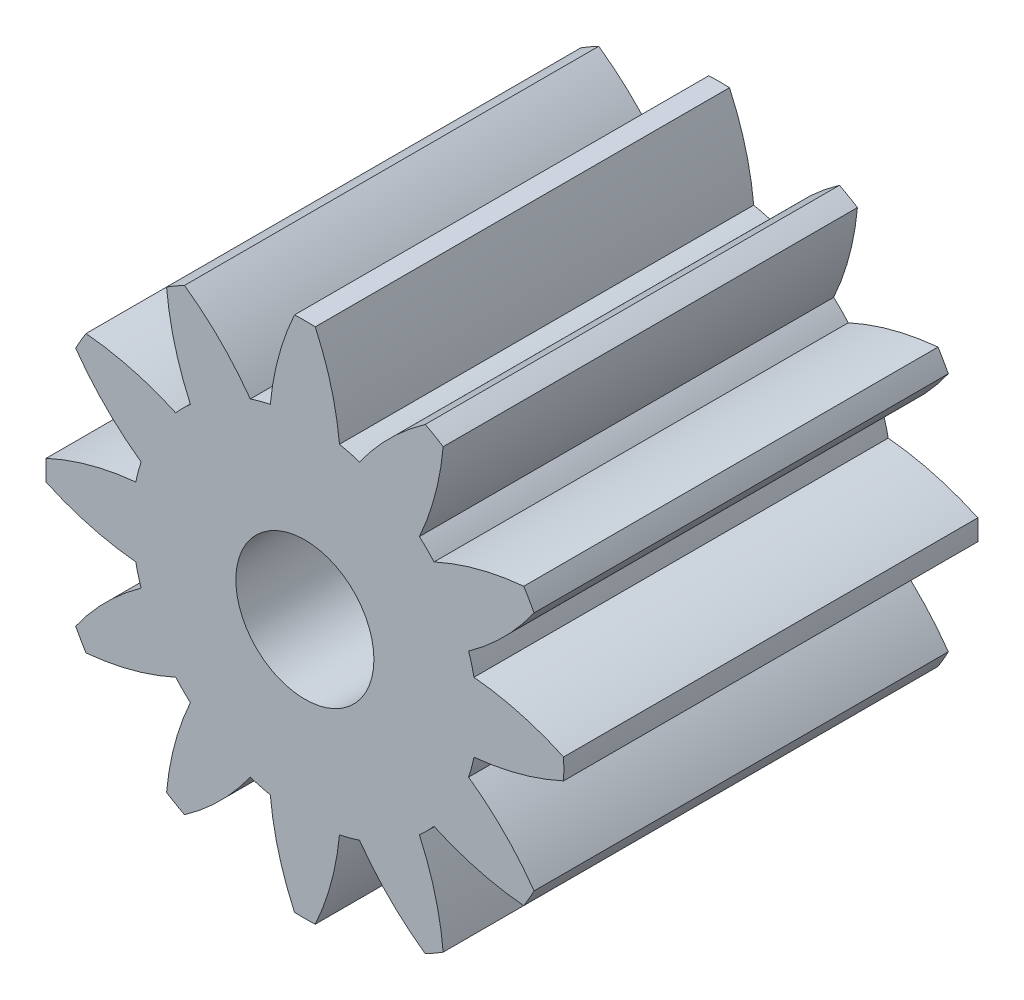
ISO-10303-21;
HEADER;
FILE_DESCRIPTION(('STEP AP214'),'2;1');
FILE_NAME('part.step','',(''),(''),'','','');
FILE_SCHEMA(('AUTOMOTIVE_DESIGN { 1 0 10303 214 1 1 1 1 }'));
ENDSEC;
DATA;
#1=APPLICATION_CONTEXT('core data for automotive mechanical design processes');
#2=APPLICATION_PROTOCOL_DEFINITION('international standard','automotive_design',2000,#1);
#3=PRODUCT_CONTEXT('',#1,'mechanical');
#4=PRODUCT('Part','Part','',(#3));
#5=PRODUCT_RELATED_PRODUCT_CATEGORY('part','',(#4));
#6=PRODUCT_DEFINITION_FORMATION('','',#4);
#7=PRODUCT_DEFINITION_CONTEXT('part definition',#1,'design');
#8=PRODUCT_DEFINITION('design','',#6,#7);
#9=PRODUCT_DEFINITION_SHAPE('','',#8);
#10=(LENGTH_UNIT() NAMED_UNIT(*) SI_UNIT(.MILLI.,.METRE.));
#11=(NAMED_UNIT(*) PLANE_ANGLE_UNIT() SI_UNIT($,.RADIAN.));
#12=(NAMED_UNIT(*) SI_UNIT($,.STERADIAN.) SOLID_ANGLE_UNIT());
#13=UNCERTAINTY_MEASURE_WITH_UNIT(LENGTH_MEASURE(1.E-05),#10,'distance_accuracy_value','');
#14=(GEOMETRIC_REPRESENTATION_CONTEXT(3) GLOBAL_UNCERTAINTY_ASSIGNED_CONTEXT((#13)) GLOBAL_UNIT_ASSIGNED_CONTEXT((#10,
#11,#12)) REPRESENTATION_CONTEXT('',''));
#15=CARTESIAN_POINT('',(0.,0.,0.));
#16=DIRECTION('',(0.,0.,1.));
#17=DIRECTION('',(1.,0.,0.));
#18=AXIS2_PLACEMENT_3D('',#15,#16,#17);
#19=CARTESIAN_POINT('',(0.,0.,6.));
#20=DIRECTION('',(0.,0.,-1.));
#21=DIRECTION('',(-1.,0.,0.));
#22=AXIS2_PLACEMENT_3D('',#19,#20,#21);
#23=CYLINDRICAL_SURFACE('',#22,3.75);
#24=CARTESIAN_POINT('',(0.,0.,6.));
#25=DIRECTION('',(0.,0.,1.));
#26=DIRECTION('',(1.,0.,0.));
#27=AXIS2_PLACEMENT_3D('',#24,#25,#26);
#28=CIRCLE('',#27,3.75);
#29=CARTESIAN_POINT('',(2.00340321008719,3.16999614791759,6.));
#30=VERTEX_POINT('',#29);
#31=CARTESIAN_POINT('',(1.74359558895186,3.31999614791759,6.));
#32=VERTEX_POINT('',#31);
#33=EDGE_CURVE('E35',#30,#32,#28,.T.);
#34=ORIENTED_EDGE('',*,*,#33,.F.);
#35=DIRECTION('',(0.,0.,1.));
#36=VECTOR('',#35,1.);
#37=CARTESIAN_POINT('',(2.00340321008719,3.16999614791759,0.));
#38=LINE('',#37,#36);
#39=CARTESIAN_POINT('',(2.00340321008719,3.16999614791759,0.));
#40=VERTEX_POINT('',#39);
#41=EDGE_CURVE('E625',#40,#30,#38,.T.);
#42=ORIENTED_EDGE('',*,*,#41,.F.);
#43=CARTESIAN_POINT('',(0.,0.,0.));
#44=DIRECTION('',(0.,0.,1.));
#45=DIRECTION('',(1.,0.,0.));
#46=AXIS2_PLACEMENT_3D('',#43,#44,#45);
#47=CIRCLE('',#46,3.75);
#48=CARTESIAN_POINT('',(1.74359558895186,3.31999614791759,0.));
#49=VERTEX_POINT('',#48);
#50=EDGE_CURVE('E662',#40,#49,#47,.T.);
#51=ORIENTED_EDGE('',*,*,#50,.T.);
#52=DIRECTION('',(0.,0.,1.));
#53=VECTOR('',#52,1.);
#54=CARTESIAN_POINT('',(1.74359558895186,3.31999614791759,0.));
#55=LINE('',#54,#53);
#56=EDGE_CURVE('E628',#49,#32,#55,.T.);
#57=ORIENTED_EDGE('',*,*,#56,.T.);
#58=EDGE_LOOP('',(#34,#42,#51,#57));
#59=FACE_BOUND('',#58,.T.);
#60=ADVANCED_FACE('F31',(#59),#23,.T.);
#61=CARTESIAN_POINT('',(3.31999614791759,1.74359558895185,6.));
#62=VERTEX_POINT('',#61);
#63=CARTESIAN_POINT('',(3.16999614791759,2.00340321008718,6.));
#64=VERTEX_POINT('',#63);
#65=EDGE_CURVE('E677',#62,#64,#28,.T.);
#66=ORIENTED_EDGE('',*,*,#65,.F.);
#67=DIRECTION('',(0.,0.,1.));
#68=VECTOR('',#67,1.);
#69=CARTESIAN_POINT('',(3.31999614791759,1.74359558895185,0.));
#70=LINE('',#69,#68);
#71=CARTESIAN_POINT('',(3.31999614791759,1.74359558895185,0.));
#72=VERTEX_POINT('',#71);
#73=EDGE_CURVE('E601',#72,#62,#70,.T.);
#74=ORIENTED_EDGE('',*,*,#73,.F.);
#75=CARTESIAN_POINT('',(3.1699961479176,2.00340321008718,0.));
#76=VERTEX_POINT('',#75);
#77=EDGE_CURVE('E664',#72,#76,#47,.T.);
#78=ORIENTED_EDGE('',*,*,#77,.T.);
#79=DIRECTION('',(0.,0.,1.));
#80=VECTOR('',#79,1.);
#81=CARTESIAN_POINT('',(3.1699961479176,2.00340321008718,0.));
#82=LINE('',#81,#80);
#83=EDGE_CURVE('E604',#76,#64,#82,.T.);
#84=ORIENTED_EDGE('',*,*,#83,.T.);
#85=EDGE_LOOP('',(#66,#74,#78,#84));
#86=FACE_BOUND('',#85,.T.);
#87=ADVANCED_FACE('F743',(#86),#23,.T.);
#88=CARTESIAN_POINT('',(3.74699879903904,-0.150000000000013,6.));
#89=VERTEX_POINT('',#88);
#90=CARTESIAN_POINT('',(3.74699879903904,0.149999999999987,6.));
#91=VERTEX_POINT('',#90);
#92=EDGE_CURVE('E733',#89,#91,#28,.T.);
#93=ORIENTED_EDGE('',*,*,#92,.F.);
#94=DIRECTION('',(0.,0.,1.));
#95=VECTOR('',#94,1.);
#96=CARTESIAN_POINT('',(3.74699879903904,-0.150000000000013,0.));
#97=LINE('',#96,#95);
#98=CARTESIAN_POINT('',(3.74699879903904,-0.150000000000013,0.));
#99=VERTEX_POINT('',#98);
#100=EDGE_CURVE('E578',#99,#89,#97,.T.);
#101=ORIENTED_EDGE('',*,*,#100,.F.);
#102=CARTESIAN_POINT('',(3.74699879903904,0.149999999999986,0.));
#103=VERTEX_POINT('',#102);
#104=EDGE_CURVE('E670',#99,#103,#47,.T.);
#105=ORIENTED_EDGE('',*,*,#104,.T.);
#106=DIRECTION('',(0.,0.,1.));
#107=VECTOR('',#106,1.);
#108=CARTESIAN_POINT('',(3.74699879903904,0.149999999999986,0.));
#109=LINE('',#108,#107);
#110=EDGE_CURVE('E581',#103,#91,#109,.T.);
#111=ORIENTED_EDGE('',*,*,#110,.T.);
#112=EDGE_LOOP('',(#93,#101,#105,#111));
#113=FACE_BOUND('',#112,.T.);
#114=ADVANCED_FACE('F721',(#113),#23,.T.);
#115=CARTESIAN_POINT('',(3.16999614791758,-2.0034032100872,6.));
#116=VERTEX_POINT('',#115);
#117=CARTESIAN_POINT('',(3.31999614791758,-1.74359558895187,6.));
#118=VERTEX_POINT('',#117);
#119=EDGE_CURVE('E735',#116,#118,#28,.T.);
#120=ORIENTED_EDGE('',*,*,#119,.F.);
#121=DIRECTION('',(0.,0.,1.));
#122=VECTOR('',#121,1.);
#123=CARTESIAN_POINT('',(3.16999614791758,-2.0034032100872,0.));
#124=LINE('',#123,#122);
#125=CARTESIAN_POINT('',(3.16999614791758,-2.0034032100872,0.));
#126=VERTEX_POINT('',#125);
#127=EDGE_CURVE('E553',#126,#116,#124,.T.);
#128=ORIENTED_EDGE('',*,*,#127,.F.);
#129=CARTESIAN_POINT('',(3.31999614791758,-1.74359558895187,0.));
#130=VERTEX_POINT('',#129);
#131=EDGE_CURVE('E708',#126,#130,#47,.T.);
#132=ORIENTED_EDGE('',*,*,#131,.T.);
#133=DIRECTION('',(0.,0.,1.));
#134=VECTOR('',#133,1.);
#135=CARTESIAN_POINT('',(3.31999614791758,-1.74359558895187,0.));
#136=LINE('',#135,#134);
#137=EDGE_CURVE('E556',#130,#118,#136,.T.);
#138=ORIENTED_EDGE('',*,*,#137,.T.);
#139=EDGE_LOOP('',(#120,#128,#132,#138));
#140=FACE_BOUND('',#139,.T.);
#141=ADVANCED_FACE('F811',(#140),#23,.T.);
#142=CARTESIAN_POINT('',(1.74359558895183,-3.3199961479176,6.));
#143=VERTEX_POINT('',#142);
#144=CARTESIAN_POINT('',(2.00340321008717,-3.1699961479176,6.));
#145=VERTEX_POINT('',#144);
#146=EDGE_CURVE('E737',#143,#145,#28,.T.);
#147=ORIENTED_EDGE('',*,*,#146,.F.);
#148=DIRECTION('',(0.,0.,1.));
#149=VECTOR('',#148,1.);
#150=CARTESIAN_POINT('',(1.74359558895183,-3.3199961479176,0.));
#151=LINE('',#150,#149);
#152=CARTESIAN_POINT('',(1.74359558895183,-3.3199961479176,0.));
#153=VERTEX_POINT('',#152);
#154=EDGE_CURVE('E527',#153,#143,#151,.T.);
#155=ORIENTED_EDGE('',*,*,#154,.F.);
#156=CARTESIAN_POINT('',(2.00340321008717,-3.1699961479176,0.));
#157=VERTEX_POINT('',#156);
#158=EDGE_CURVE('E703',#153,#157,#47,.T.);
#159=ORIENTED_EDGE('',*,*,#158,.T.);
#160=DIRECTION('',(0.,0.,1.));
#161=VECTOR('',#160,1.);
#162=CARTESIAN_POINT('',(2.00340321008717,-3.1699961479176,0.));
#163=LINE('',#162,#161);
#164=EDGE_CURVE('E530',#157,#145,#163,.T.);
#165=ORIENTED_EDGE('',*,*,#164,.T.);
#166=EDGE_LOOP('',(#147,#155,#159,#165));
#167=FACE_BOUND('',#166,.T.);
#168=ADVANCED_FACE('F800',(#167),#23,.T.);
#169=CARTESIAN_POINT('',(-0.150000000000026,-3.74699879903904,6.));
#170=VERTEX_POINT('',#169);
#171=CARTESIAN_POINT('',(0.149999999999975,-3.74699879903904,6.));
#172=VERTEX_POINT('',#171);
#173=EDGE_CURVE('E786',#170,#172,#28,.T.);
#174=ORIENTED_EDGE('',*,*,#173,.F.);
#175=DIRECTION('',(0.,0.,1.));
#176=VECTOR('',#175,1.);
#177=CARTESIAN_POINT('',(-0.150000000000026,-3.74699879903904,0.));
#178=LINE('',#177,#176);
#179=CARTESIAN_POINT('',(-0.150000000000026,-3.74699879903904,0.));
#180=VERTEX_POINT('',#179);
#181=EDGE_CURVE('E501',#180,#170,#178,.T.);
#182=ORIENTED_EDGE('',*,*,#181,.F.);
#183=CARTESIAN_POINT('',(0.149999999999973,-3.74699879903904,0.));
#184=VERTEX_POINT('',#183);
#185=EDGE_CURVE('E698',#180,#184,#47,.T.);
#186=ORIENTED_EDGE('',*,*,#185,.T.);
#187=DIRECTION('',(0.,0.,1.));
#188=VECTOR('',#187,1.);
#189=CARTESIAN_POINT('',(0.149999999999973,-3.74699879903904,0.));
#190=LINE('',#189,#188);
#191=EDGE_CURVE('E504',#184,#172,#190,.T.);
#192=ORIENTED_EDGE('',*,*,#191,.T.);
#193=EDGE_LOOP('',(#174,#182,#186,#192));
#194=FACE_BOUND('',#193,.T.);
#195=ADVANCED_FACE('F887',(#194),#23,.T.);
#196=CARTESIAN_POINT('',(-2.00340321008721,-3.16999614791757,6.));
#197=VERTEX_POINT('',#196);
#198=CARTESIAN_POINT('',(-1.74359558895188,-3.31999614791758,6.));
#199=VERTEX_POINT('',#198);
#200=EDGE_CURVE('E781',#197,#199,#28,.T.);
#201=ORIENTED_EDGE('',*,*,#200,.F.);
#202=DIRECTION('',(0.,0.,1.));
#203=VECTOR('',#202,1.);
#204=CARTESIAN_POINT('',(-2.00340321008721,-3.16999614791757,0.));
#205=LINE('',#204,#203);
#206=CARTESIAN_POINT('',(-2.00340321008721,-3.16999614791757,0.));
#207=VERTEX_POINT('',#206);
#208=EDGE_CURVE('E475',#207,#197,#205,.T.);
#209=ORIENTED_EDGE('',*,*,#208,.F.);
#210=CARTESIAN_POINT('',(-1.74359558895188,-3.31999614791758,0.));
#211=VERTEX_POINT('',#210);
#212=EDGE_CURVE('E693',#207,#211,#47,.T.);
#213=ORIENTED_EDGE('',*,*,#212,.T.);
#214=DIRECTION('',(0.,0.,1.));
#215=VECTOR('',#214,1.);
#216=CARTESIAN_POINT('',(-1.74359558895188,-3.31999614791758,0.));
#217=LINE('',#216,#215);
#218=EDGE_CURVE('E478',#211,#199,#217,.T.);
#219=ORIENTED_EDGE('',*,*,#218,.T.);
#220=EDGE_LOOP('',(#201,#209,#213,#219));
#221=FACE_BOUND('',#220,.T.);
#222=ADVANCED_FACE('F878',(#221),#23,.T.);
#223=CARTESIAN_POINT('',(-3.31999614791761,-1.74359558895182,6.));
#224=VERTEX_POINT('',#223);
#225=CARTESIAN_POINT('',(-3.16999614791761,-2.00340321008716,6.));
#226=VERTEX_POINT('',#225);
#227=EDGE_CURVE('E776',#224,#226,#28,.T.);
#228=ORIENTED_EDGE('',*,*,#227,.F.);
#229=DIRECTION('',(0.,0.,1.));
#230=VECTOR('',#229,1.);
#231=CARTESIAN_POINT('',(-3.31999614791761,-1.74359558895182,0.));
#232=LINE('',#231,#230);
#233=CARTESIAN_POINT('',(-3.31999614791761,-1.74359558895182,0.));
#234=VERTEX_POINT('',#233);
#235=EDGE_CURVE('E449',#234,#224,#232,.T.);
#236=ORIENTED_EDGE('',*,*,#235,.F.);
#237=CARTESIAN_POINT('',(-3.16999614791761,-2.00340321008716,0.));
#238=VERTEX_POINT('',#237);
#239=EDGE_CURVE('E688',#234,#238,#47,.T.);
#240=ORIENTED_EDGE('',*,*,#239,.T.);
#241=DIRECTION('',(0.,0.,1.));
#242=VECTOR('',#241,1.);
#243=CARTESIAN_POINT('',(-3.16999614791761,-2.00340321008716,0.));
#244=LINE('',#243,#242);
#245=EDGE_CURVE('E452',#238,#226,#244,.T.);
#246=ORIENTED_EDGE('',*,*,#245,.T.);
#247=EDGE_LOOP('',(#228,#236,#240,#246));
#248=FACE_BOUND('',#247,.T.);
#249=ADVANCED_FACE('F853',(#248),#23,.T.);
#250=CARTESIAN_POINT('',(-3.74699879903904,0.150000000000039,6.));
#251=VERTEX_POINT('',#250);
#252=CARTESIAN_POINT('',(-3.74699879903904,-0.149999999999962,6.));
#253=VERTEX_POINT('',#252);
#254=EDGE_CURVE('E771',#251,#253,#28,.T.);
#255=ORIENTED_EDGE('',*,*,#254,.F.);
#256=DIRECTION('',(0.,0.,1.));
#257=VECTOR('',#256,1.);
#258=CARTESIAN_POINT('',(-3.74699879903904,0.150000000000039,0.));
#259=LINE('',#258,#257);
#260=CARTESIAN_POINT('',(-3.74699879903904,0.150000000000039,0.));
#261=VERTEX_POINT('',#260);
#262=EDGE_CURVE('E423',#261,#251,#259,.T.);
#263=ORIENTED_EDGE('',*,*,#262,.F.);
#264=CARTESIAN_POINT('',(-3.74699879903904,-0.14999999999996,0.));
#265=VERTEX_POINT('',#264);
#266=EDGE_CURVE('E683',#261,#265,#47,.T.);
#267=ORIENTED_EDGE('',*,*,#266,.T.);
#268=DIRECTION('',(0.,0.,1.));
#269=VECTOR('',#268,1.);
#270=CARTESIAN_POINT('',(-3.74699879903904,-0.14999999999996,0.));
#271=LINE('',#270,#269);
#272=EDGE_CURVE('E426',#265,#253,#271,.T.);
#273=ORIENTED_EDGE('',*,*,#272,.T.);
#274=EDGE_LOOP('',(#255,#263,#267,#273));
#275=FACE_BOUND('',#274,.T.);
#276=ADVANCED_FACE('F849',(#275),#23,.T.);
#277=CARTESIAN_POINT('',(-3.16999614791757,2.00340321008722,6.));
#278=VERTEX_POINT('',#277);
#279=CARTESIAN_POINT('',(-3.31999614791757,1.74359558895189,6.));
#280=VERTEX_POINT('',#279);
#281=EDGE_CURVE('E769',#278,#280,#28,.T.);
#282=ORIENTED_EDGE('',*,*,#281,.F.);
#283=DIRECTION('',(0.,0.,1.));
#284=VECTOR('',#283,1.);
#285=CARTESIAN_POINT('',(-3.16999614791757,2.00340321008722,0.));
#286=LINE('',#285,#284);
#287=CARTESIAN_POINT('',(-3.16999614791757,2.00340321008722,0.));
#288=VERTEX_POINT('',#287);
#289=EDGE_CURVE('E397',#288,#278,#286,.T.);
#290=ORIENTED_EDGE('',*,*,#289,.F.);
#291=CARTESIAN_POINT('',(-3.31999614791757,1.74359558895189,0.));
#292=VERTEX_POINT('',#291);
#293=EDGE_CURVE('E679',#288,#292,#47,.T.);
#294=ORIENTED_EDGE('',*,*,#293,.T.);
#295=DIRECTION('',(0.,0.,1.));
#296=VECTOR('',#295,1.);
#297=CARTESIAN_POINT('',(-3.31999614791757,1.74359558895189,0.));
#298=LINE('',#297,#296);
#299=EDGE_CURVE('E400',#292,#280,#298,.T.);
#300=ORIENTED_EDGE('',*,*,#299,.T.);
#301=EDGE_LOOP('',(#282,#290,#294,#300));
#302=FACE_BOUND('',#301,.T.);
#303=ADVANCED_FACE('F844',(#302),#23,.T.);
#304=CARTESIAN_POINT('',(0.15,3.74699879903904,6.));
#305=VERTEX_POINT('',#304);
#306=CARTESIAN_POINT('',(-0.15,3.74699879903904,6.));
#307=VERTEX_POINT('',#306);
#308=EDGE_CURVE('E11',#305,#307,#28,.T.);
#309=ORIENTED_EDGE('',*,*,#308,.F.);
#310=DIRECTION('',(0.,0.,1.));
#311=VECTOR('',#310,1.);
#312=CARTESIAN_POINT('',(0.15,3.74699879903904,0.));
#313=LINE('',#312,#311);
#314=CARTESIAN_POINT('',(0.15,3.74699879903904,0.));
#315=VERTEX_POINT('',#314);
#316=EDGE_CURVE('E649',#315,#305,#313,.T.);
#317=ORIENTED_EDGE('',*,*,#316,.F.);
#318=CARTESIAN_POINT('',(-0.15,3.74699879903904,0.));
#319=VERTEX_POINT('',#318);
#320=EDGE_CURVE('E665',#315,#319,#47,.T.);
#321=ORIENTED_EDGE('',*,*,#320,.T.);
#322=DIRECTION('',(0.,0.,1.));
#323=VECTOR('',#322,1.);
#324=CARTESIAN_POINT('',(-0.15,3.74699879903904,0.));
#325=LINE('',#324,#323);
#326=EDGE_CURVE('E652',#319,#307,#325,.T.);
#327=ORIENTED_EDGE('',*,*,#326,.T.);
#328=EDGE_LOOP('',(#309,#317,#321,#327));
#329=FACE_BOUND('',#328,.T.);
#330=ADVANCED_FACE('F764',(#329),#23,.T.);
#331=CARTESIAN_POINT('',(0.,0.,6.));
#332=DIRECTION('',(0.,0.,1.));
#333=DIRECTION('',(1.,0.,0.));
#334=AXIS2_PLACEMENT_3D('',#331,#332,#333);
#335=PLANE('',#334);
#336=CARTESIAN_POINT('',(4.04882633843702,0.0510649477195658,6.));
#337=DIRECTION('',(0.,0.,-1.));
#338=DIRECTION('',(0.866025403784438,-0.500000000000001,0.));
#339=AXIS2_PLACEMENT_3D('',#336,#337,#338);
#340=CIRCLE('',#339,4.);
#341=CARTESIAN_POINT('',(0.790770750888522,2.37164112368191,6.));
#342=VERTEX_POINT('',#341);
#343=EDGE_CURVE('E613',#342,#32,#340,.T.);
#344=ORIENTED_EDGE('',*,*,#343,.F.);
#345=CARTESIAN_POINT('',(0.,0.,6.));
#346=DIRECTION('',(0.,0.,-1.));
#347=DIRECTION('',(-1.,0.,0.));
#348=AXIS2_PLACEMENT_3D('',#345,#346,#347);
#349=CIRCLE('',#348,2.5);
#350=CARTESIAN_POINT('',(0.500993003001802,2.44928683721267,6.));
#351=VERTEX_POINT('',#350);
#352=EDGE_CURVE('E351',#351,#342,#349,.T.);
#353=ORIENTED_EDGE('',*,*,#352,.F.);
#354=CARTESIAN_POINT('',(-3.4808539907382,2.06863671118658,6.));
#355=DIRECTION('',(0.,0.,-1.));
#356=DIRECTION('',(-1.,0.,0.));
#357=AXIS2_PLACEMENT_3D('',#354,#355,#356);
#358=CIRCLE('',#357,4.);
#359=EDGE_CURVE('E627',#305,#351,#358,.T.);
#360=ORIENTED_EDGE('',*,*,#359,.F.);
#361=ORIENTED_EDGE('',*,*,#308,.T.);
#362=CARTESIAN_POINT('',(3.4808539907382,2.06863671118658,6.));
#363=DIRECTION('',(0.,0.,-1.));
#364=DIRECTION('',(1.,0.,0.));
#365=AXIS2_PLACEMENT_3D('',#362,#363,#364);
#366=CIRCLE('',#365,4.);
#367=CARTESIAN_POINT('',(-0.500993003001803,2.44928683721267,6.));
#368=VERTEX_POINT('',#367);
#369=EDGE_CURVE('E349',#368,#307,#366,.T.);
#370=ORIENTED_EDGE('',*,*,#369,.F.);
#371=CARTESIAN_POINT('',(0.,0.,6.));
#372=DIRECTION('',(0.,0.,-1.));
#373=DIRECTION('',(1.,0.,0.));
#374=AXIS2_PLACEMENT_3D('',#371,#372,#373);
#375=CIRCLE('',#374,2.5);
#376=CARTESIAN_POINT('',(-0.79077075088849,2.37164112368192,6.));
#377=VERTEX_POINT('',#376);
#378=EDGE_CURVE('E340',#377,#368,#375,.T.);
#379=ORIENTED_EDGE('',*,*,#378,.F.);
#380=CARTESIAN_POINT('',(-4.04882633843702,0.0510649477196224,6.));
#381=DIRECTION('',(0.,0.,-1.));
#382=DIRECTION('',(-0.866025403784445,-0.499999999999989,0.));
#383=AXIS2_PLACEMENT_3D('',#380,#381,#382);
#384=CIRCLE('',#383,4.);
#385=CARTESIAN_POINT('',(-1.74359558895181,3.31999614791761,6.));
#386=VERTEX_POINT('',#385);
#387=EDGE_CURVE('E347',#386,#377,#384,.T.);
#388=ORIENTED_EDGE('',*,*,#387,.F.);
#389=CARTESIAN_POINT('',(-2.00340321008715,3.16999614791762,6.));
#390=VERTEX_POINT('',#389);
#391=EDGE_CURVE('E40',#386,#390,#28,.T.);
#392=ORIENTED_EDGE('',*,*,#391,.T.);
#393=CARTESIAN_POINT('',(1.98018962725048,3.53191893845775,6.));
#394=DIRECTION('',(0.,0.,-1.));
#395=DIRECTION('',(0.866025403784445,0.499999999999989,0.));
#396=AXIS2_PLACEMENT_3D('',#393,#394,#395);
#397=CIRCLE('',#396,4.);
#398=CARTESIAN_POINT('',(-1.65851608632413,1.87064812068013,6.));
#399=VERTEX_POINT('',#398);
#400=EDGE_CURVE('E366',#399,#390,#397,.T.);
#401=ORIENTED_EDGE('',*,*,#400,.F.);
#402=CARTESIAN_POINT('',(0.,0.,6.));
#403=DIRECTION('',(0.,0.,-1.));
#404=DIRECTION('',(-0.50000000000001,-0.866025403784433,0.));
#405=AXIS2_PLACEMENT_3D('',#402,#403,#404);
#406=CIRCLE('',#405,2.5);
#407=CARTESIAN_POINT('',(-1.87064812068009,1.65851608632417,6.));
#408=VERTEX_POINT('',#407);
#409=EDGE_CURVE('E383',#408,#399,#406,.T.);
#410=ORIENTED_EDGE('',*,*,#409,.F.);
#411=CARTESIAN_POINT('',(-3.5319189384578,-1.9801896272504,6.));
#412=DIRECTION('',(0.,0.,-1.));
#413=DIRECTION('',(-0.50000000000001,-0.866025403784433,0.));
#414=AXIS2_PLACEMENT_3D('',#411,#412,#413);
#415=CIRCLE('',#414,4.);
#416=EDGE_CURVE('E375',#278,#408,#415,.T.);
#417=ORIENTED_EDGE('',*,*,#416,.F.);
#418=ORIENTED_EDGE('',*,*,#281,.T.);
#419=CARTESIAN_POINT('',(-0.0510649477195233,4.04882633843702,6.));
#420=DIRECTION('',(0.,0.,-1.));
#421=DIRECTION('',(0.50000000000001,0.866025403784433,0.));
#422=AXIS2_PLACEMENT_3D('',#419,#420,#421);
#423=CIRCLE('',#422,4.);
#424=CARTESIAN_POINT('',(-2.3716411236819,0.790770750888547,6.));
#425=VERTEX_POINT('',#424);
#426=EDGE_CURVE('E385',#425,#280,#423,.T.);
#427=ORIENTED_EDGE('',*,*,#426,.F.);
#428=CARTESIAN_POINT('',(0.,0.,6.));
#429=DIRECTION('',(0.,0.,-1.));
#430=DIRECTION('',(0.,-1.,0.));
#431=AXIS2_PLACEMENT_3D('',#428,#429,#430);
#432=CIRCLE('',#431,2.5);
#433=CARTESIAN_POINT('',(-2.44928683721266,0.500993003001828,6.));
#434=VERTEX_POINT('',#433);
#435=EDGE_CURVE('E409',#434,#425,#432,.T.);
#436=ORIENTED_EDGE('',*,*,#435,.F.);
#437=CARTESIAN_POINT('',(-2.06863671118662,-3.48085399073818,6.));
#438=DIRECTION('',(0.,0.,-1.));
#439=DIRECTION('',(0.,-1.,0.));
#440=AXIS2_PLACEMENT_3D('',#437,#438,#439);
#441=CIRCLE('',#440,4.);
#442=EDGE_CURVE('E399',#251,#434,#441,.T.);
#443=ORIENTED_EDGE('',*,*,#442,.F.);
#444=ORIENTED_EDGE('',*,*,#254,.T.);
#445=CARTESIAN_POINT('',(-2.06863671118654,3.48085399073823,6.));
#446=DIRECTION('',(0.,0.,-1.));
#447=DIRECTION('',(0.,1.,0.));
#448=AXIS2_PLACEMENT_3D('',#445,#446,#447);
#449=CIRCLE('',#448,4.);
#450=CARTESIAN_POINT('',(-2.44928683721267,-0.500993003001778,6.));
#451=VERTEX_POINT('',#450);
#452=EDGE_CURVE('E411',#451,#253,#449,.T.);
#453=ORIENTED_EDGE('',*,*,#452,.F.);
#454=CARTESIAN_POINT('',(0.,0.,6.));
#455=DIRECTION('',(0.,0.,-1.));
#456=DIRECTION('',(0.499999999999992,-0.866025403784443,0.));
#457=AXIS2_PLACEMENT_3D('',#454,#455,#456);
#458=CIRCLE('',#457,2.5);
#459=CARTESIAN_POINT('',(-2.37164112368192,-0.790770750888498,6.));
#460=VERTEX_POINT('',#459);
#461=EDGE_CURVE('E435',#460,#451,#458,.T.);
#462=ORIENTED_EDGE('',*,*,#461,.F.);
#463=CARTESIAN_POINT('',(-0.0510649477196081,-4.04882633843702,6.));
#464=DIRECTION('',(0.,0.,-1.));
#465=DIRECTION('',(0.499999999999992,-0.866025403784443,0.));
#466=AXIS2_PLACEMENT_3D('',#463,#464,#465);
#467=CIRCLE('',#466,4.);
#468=EDGE_CURVE('E425',#224,#460,#467,.T.);
#469=ORIENTED_EDGE('',*,*,#468,.F.);
#470=ORIENTED_EDGE('',*,*,#227,.T.);
#471=CARTESIAN_POINT('',(-3.53191893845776,1.98018962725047,6.));
#472=DIRECTION('',(0.,0.,-1.));
#473=DIRECTION('',(-0.499999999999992,0.866025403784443,0.));
#474=AXIS2_PLACEMENT_3D('',#471,#472,#473);
#475=CIRCLE('',#474,4.);
#476=CARTESIAN_POINT('',(-1.87064812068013,-1.65851608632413,6.));
#477=VERTEX_POINT('',#476);
#478=EDGE_CURVE('E437',#477,#226,#475,.T.);
#479=ORIENTED_EDGE('',*,*,#478,.F.);
#480=CARTESIAN_POINT('',(0.,0.,6.));
#481=DIRECTION('',(0.,0.,-1.));
#482=DIRECTION('',(0.866025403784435,-0.500000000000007,0.));
#483=AXIS2_PLACEMENT_3D('',#480,#481,#482);
#484=CIRCLE('',#483,2.5);
#485=CARTESIAN_POINT('',(-1.65851608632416,-1.8706481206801,6.));
#486=VERTEX_POINT('',#485);
#487=EDGE_CURVE('E461',#486,#477,#484,.T.);
#488=ORIENTED_EDGE('',*,*,#487,.F.);
#489=CARTESIAN_POINT('',(1.98018962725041,-3.53191893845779,6.));
#490=DIRECTION('',(0.,0.,-1.));
#491=DIRECTION('',(0.866025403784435,-0.500000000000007,0.));
#492=AXIS2_PLACEMENT_3D('',#489,#490,#491);
#493=CIRCLE('',#492,4.);
#494=EDGE_CURVE('E451',#197,#486,#493,.T.);
#495=ORIENTED_EDGE('',*,*,#494,.F.);
#496=ORIENTED_EDGE('',*,*,#200,.T.);
#497=CARTESIAN_POINT('',(-4.04882633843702,-0.0510649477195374,6.));
#498=DIRECTION('',(0.,0.,-1.));
#499=DIRECTION('',(-0.866025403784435,0.500000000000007,0.));
#500=AXIS2_PLACEMENT_3D('',#497,#498,#499);
#501=CIRCLE('',#500,4.);
#502=CARTESIAN_POINT('',(-0.790770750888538,-2.37164112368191,6.));
#503=VERTEX_POINT('',#502);
#504=EDGE_CURVE('E463',#503,#199,#501,.T.);
#505=ORIENTED_EDGE('',*,*,#504,.F.);
#506=CARTESIAN_POINT('',(0.,0.,6.));
#507=DIRECTION('',(0.,0.,-1.));
#508=DIRECTION('',(1.,0.,0.));
#509=AXIS2_PLACEMENT_3D('',#506,#507,#508);
#510=CIRCLE('',#509,2.5);
#511=CARTESIAN_POINT('',(-0.500993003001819,-2.44928683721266,6.));
#512=VERTEX_POINT('',#511);
#513=EDGE_CURVE('E487',#512,#503,#510,.T.);
#514=ORIENTED_EDGE('',*,*,#513,.F.);
#515=CARTESIAN_POINT('',(3.48085399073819,-2.06863671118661,6.));
#516=DIRECTION('',(0.,0.,-1.));
#517=DIRECTION('',(1.,0.,0.));
#518=AXIS2_PLACEMENT_3D('',#515,#516,#517);
#519=CIRCLE('',#518,4.);
#520=EDGE_CURVE('E477',#170,#512,#519,.T.);
#521=ORIENTED_EDGE('',*,*,#520,.F.);
#522=ORIENTED_EDGE('',*,*,#173,.T.);
#523=CARTESIAN_POINT('',(-3.48085399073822,-2.06863671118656,6.));
#524=DIRECTION('',(0.,0.,-1.));
#525=DIRECTION('',(-1.,0.,0.));
#526=AXIS2_PLACEMENT_3D('',#523,#524,#525);
#527=CIRCLE('',#526,4.);
#528=CARTESIAN_POINT('',(0.500993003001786,-2.44928683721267,6.));
#529=VERTEX_POINT('',#528);
#530=EDGE_CURVE('E489',#529,#172,#527,.T.);
#531=ORIENTED_EDGE('',*,*,#530,.F.);
#532=CARTESIAN_POINT('',(0.,0.,6.));
#533=DIRECTION('',(0.,0.,-1.));
#534=DIRECTION('',(0.866025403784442,0.499999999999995,0.));
#535=AXIS2_PLACEMENT_3D('',#532,#533,#534);
#536=CIRCLE('',#535,2.5);
#537=CARTESIAN_POINT('',(0.790770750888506,-2.37164112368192,6.));
#538=VERTEX_POINT('',#537);
#539=EDGE_CURVE('E513',#538,#529,#536,.T.);
#540=ORIENTED_EDGE('',*,*,#539,.F.);
#541=CARTESIAN_POINT('',(4.04882633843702,-0.0510649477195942,6.));
#542=DIRECTION('',(0.,0.,-1.));
#543=DIRECTION('',(0.866025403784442,0.499999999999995,0.));
#544=AXIS2_PLACEMENT_3D('',#541,#542,#543);
#545=CIRCLE('',#544,4.);
#546=EDGE_CURVE('E503',#143,#538,#545,.T.);
#547=ORIENTED_EDGE('',*,*,#546,.F.);
#548=ORIENTED_EDGE('',*,*,#146,.T.);
#549=CARTESIAN_POINT('',(-1.98018962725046,-3.53191893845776,6.));
#550=DIRECTION('',(0.,0.,-1.));
#551=DIRECTION('',(-0.866025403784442,-0.499999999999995,0.));
#552=AXIS2_PLACEMENT_3D('',#549,#550,#551);
#553=CIRCLE('',#552,4.);
#554=CARTESIAN_POINT('',(1.65851608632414,-1.87064812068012,6.));
#555=VERTEX_POINT('',#554);
#556=EDGE_CURVE('E515',#555,#145,#553,.T.);
#557=ORIENTED_EDGE('',*,*,#556,.F.);
#558=CARTESIAN_POINT('',(0.,0.,6.));
#559=DIRECTION('',(0.,0.,-1.));
#560=DIRECTION('',(0.500000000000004,0.866025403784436,0.));
#561=AXIS2_PLACEMENT_3D('',#558,#559,#560);
#562=CIRCLE('',#561,2.5);
#563=CARTESIAN_POINT('',(1.8706481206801,-1.65851608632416,6.));
#564=VERTEX_POINT('',#563);
#565=EDGE_CURVE('E539',#564,#555,#562,.T.);
#566=ORIENTED_EDGE('',*,*,#565,.F.);
#567=CARTESIAN_POINT('',(3.53191893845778,1.98018962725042,6.));
#568=DIRECTION('',(0.,0.,-1.));
#569=DIRECTION('',(0.500000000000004,0.866025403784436,0.));
#570=AXIS2_PLACEMENT_3D('',#567,#568,#569);
#571=CIRCLE('',#570,4.);
#572=EDGE_CURVE('E529',#116,#564,#571,.T.);
#573=ORIENTED_EDGE('',*,*,#572,.F.);
#574=ORIENTED_EDGE('',*,*,#119,.T.);
#575=CARTESIAN_POINT('',(0.0510649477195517,-4.04882633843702,6.));
#576=DIRECTION('',(0.,0.,-1.));
#577=DIRECTION('',(-0.500000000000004,-0.866025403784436,0.));
#578=AXIS2_PLACEMENT_3D('',#575,#576,#577);
#579=CIRCLE('',#578,4.);
#580=CARTESIAN_POINT('',(2.37164112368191,-0.79077075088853,6.));
#581=VERTEX_POINT('',#580);
#582=EDGE_CURVE('E541',#581,#118,#579,.T.);
#583=ORIENTED_EDGE('',*,*,#582,.F.);
#584=CARTESIAN_POINT('',(0.,0.,6.));
#585=DIRECTION('',(0.,0.,-1.));
#586=DIRECTION('',(0.,1.,0.));
#587=AXIS2_PLACEMENT_3D('',#584,#585,#586);
#588=CIRCLE('',#587,2.5);
#589=CARTESIAN_POINT('',(2.44928683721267,-0.500993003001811,6.));
#590=VERTEX_POINT('',#589);
#591=EDGE_CURVE('E565',#590,#581,#588,.T.);
#592=ORIENTED_EDGE('',*,*,#591,.F.);
#593=CARTESIAN_POINT('',(2.06863671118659,3.4808539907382,6.));
#594=DIRECTION('',(0.,0.,-1.));
#595=DIRECTION('',(0.,1.,0.));
#596=AXIS2_PLACEMENT_3D('',#593,#594,#595);
#597=CIRCLE('',#596,4.);
#598=EDGE_CURVE('E555',#89,#590,#597,.T.);
#599=ORIENTED_EDGE('',*,*,#598,.F.);
#600=ORIENTED_EDGE('',*,*,#92,.T.);
#601=CARTESIAN_POINT('',(2.06863671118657,-3.48085399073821,6.));
#602=DIRECTION('',(0.,0.,-1.));
#603=DIRECTION('',(0.,-1.,0.));
#604=AXIS2_PLACEMENT_3D('',#601,#602,#603);
#605=CIRCLE('',#604,4.);
#606=CARTESIAN_POINT('',(2.44928683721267,0.500993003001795,6.));
#607=VERTEX_POINT('',#606);
#608=EDGE_CURVE('E55',#607,#91,#605,.T.);
#609=ORIENTED_EDGE('',*,*,#608,.F.);
#610=CARTESIAN_POINT('',(0.,0.,6.));
#611=DIRECTION('',(0.,0.,-1.));
#612=DIRECTION('',(-0.499999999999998,0.86602540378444,0.));
#613=AXIS2_PLACEMENT_3D('',#610,#611,#612);
#614=CIRCLE('',#613,2.5);
#615=CARTESIAN_POINT('',(2.37164112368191,0.790770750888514,6.));
#616=VERTEX_POINT('',#615);
#617=EDGE_CURVE('E588',#616,#607,#614,.T.);
#618=ORIENTED_EDGE('',*,*,#617,.F.);
#619=CARTESIAN_POINT('',(0.0510649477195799,4.04882633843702,6.));
#620=DIRECTION('',(0.,0.,-1.));
#621=DIRECTION('',(-0.499999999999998,0.86602540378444,0.));
#622=AXIS2_PLACEMENT_3D('',#619,#620,#621);
#623=CIRCLE('',#622,4.);
#624=EDGE_CURVE('E580',#62,#616,#623,.T.);
#625=ORIENTED_EDGE('',*,*,#624,.F.);
#626=ORIENTED_EDGE('',*,*,#65,.T.);
#627=CARTESIAN_POINT('',(3.53191893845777,-1.98018962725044,6.));
#628=DIRECTION('',(0.,0.,-1.));
#629=DIRECTION('',(0.499999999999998,-0.86602540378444,0.));
#630=AXIS2_PLACEMENT_3D('',#627,#628,#629);
#631=CIRCLE('',#630,4.);
#632=CARTESIAN_POINT('',(1.87064812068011,1.65851608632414,6.));
#633=VERTEX_POINT('',#632);
#634=EDGE_CURVE('E47',#633,#64,#631,.T.);
#635=ORIENTED_EDGE('',*,*,#634,.F.);
#636=CARTESIAN_POINT('',(0.,0.,6.));
#637=DIRECTION('',(0.,0.,-1.));
#638=DIRECTION('',(-0.866025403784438,0.500000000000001,0.));
#639=AXIS2_PLACEMENT_3D('',#636,#637,#638);
#640=CIRCLE('',#639,2.5);
#641=CARTESIAN_POINT('',(1.65851608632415,1.87064812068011,6.));
#642=VERTEX_POINT('',#641);
#643=EDGE_CURVE('E611',#642,#633,#640,.T.);
#644=ORIENTED_EDGE('',*,*,#643,.F.);
#645=CARTESIAN_POINT('',(-1.98018962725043,3.53191893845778,6.));
#646=DIRECTION('',(0.,0.,-1.));
#647=DIRECTION('',(-0.866025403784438,0.500000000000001,0.));
#648=AXIS2_PLACEMENT_3D('',#645,#646,#647);
#649=CIRCLE('',#648,4.);
#650=EDGE_CURVE('E603',#30,#642,#649,.T.);
#651=ORIENTED_EDGE('',*,*,#650,.F.);
#652=ORIENTED_EDGE('',*,*,#33,.T.);
#653=EDGE_LOOP('',(#344,#353,#360,#361,#370,#379,#388,#392,#401,#410,#417,#418,#427,#436,#443,
#444,#453,#462,#469,#470,#479,#488,#495,#496,#505,#514,#521,#522,#531,#540,#547,#548,#557,#566,
#573,#574,#583,#592,#599,#600,#609,#618,#625,#626,#635,#644,#651,#652));
#654=FACE_BOUND('',#653,.T.);
#655=CARTESIAN_POINT('',(0.,0.,6.));
#656=DIRECTION('',(0.,0.,1.));
#657=DIRECTION('',(1.,0.,0.));
#658=AXIS2_PLACEMENT_3D('',#655,#656,#657);
#659=CIRCLE('',#658,1.);
#660=CARTESIAN_POINT('',(1.,0.,6.));
#661=VERTEX_POINT('',#660);
#662=EDGE_CURVE('E660',#661,#661,#659,.T.);
#663=ORIENTED_EDGE('',*,*,#662,.F.);
#664=EDGE_LOOP('',(#663));
#665=FACE_BOUND('',#664,.T.);
#666=ADVANCED_FACE('F343',(#654,#665),#335,.T.);
#667=CARTESIAN_POINT('',(0.,0.,0.));
#668=DIRECTION('',(0.,0.,1.));
#669=DIRECTION('',(1.,0.,0.));
#670=AXIS2_PLACEMENT_3D('',#667,#668,#669);
#671=PLANE('',#670);
#672=CARTESIAN_POINT('',(0.,0.,0.));
#673=DIRECTION('',(0.,0.,-1.));
#674=DIRECTION('',(-1.,0.,0.));
#675=AXIS2_PLACEMENT_3D('',#672,#673,#674);
#676=CIRCLE('',#675,2.5);
#677=CARTESIAN_POINT('',(0.500993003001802,2.44928683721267,0.));
#678=VERTEX_POINT('',#677);
#679=CARTESIAN_POINT('',(0.790770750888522,2.37164112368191,0.));
#680=VERTEX_POINT('',#679);
#681=EDGE_CURVE('E642',#678,#680,#676,.T.);
#682=ORIENTED_EDGE('',*,*,#681,.T.);
#683=CARTESIAN_POINT('',(4.04882633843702,0.0510649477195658,0.));
#684=DIRECTION('',(0.,0.,-1.));
#685=DIRECTION('',(0.866025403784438,-0.500000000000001,0.));
#686=AXIS2_PLACEMENT_3D('',#683,#684,#685);
#687=CIRCLE('',#686,4.);
#688=EDGE_CURVE('E621',#680,#49,#687,.T.);
#689=ORIENTED_EDGE('',*,*,#688,.T.);
#690=ORIENTED_EDGE('',*,*,#50,.F.);
#691=CARTESIAN_POINT('',(-1.98018962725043,3.53191893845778,0.));
#692=DIRECTION('',(0.,0.,-1.));
#693=DIRECTION('',(-0.866025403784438,0.500000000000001,0.));
#694=AXIS2_PLACEMENT_3D('',#691,#692,#693);
#695=CIRCLE('',#694,4.);
#696=CARTESIAN_POINT('',(1.65851608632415,1.87064812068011,0.));
#697=VERTEX_POINT('',#696);
#698=EDGE_CURVE('E615',#40,#697,#695,.T.);
#699=ORIENTED_EDGE('',*,*,#698,.T.);
#700=CARTESIAN_POINT('',(0.,0.,0.));
#701=DIRECTION('',(0.,0.,-1.));
#702=DIRECTION('',(-0.866025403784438,0.500000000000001,0.));
#703=AXIS2_PLACEMENT_3D('',#700,#701,#702);
#704=CIRCLE('',#703,2.5);
#705=CARTESIAN_POINT('',(1.87064812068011,1.65851608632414,0.));
#706=VERTEX_POINT('',#705);
#707=EDGE_CURVE('E618',#697,#706,#704,.T.);
#708=ORIENTED_EDGE('',*,*,#707,.T.);
#709=CARTESIAN_POINT('',(3.53191893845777,-1.98018962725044,0.));
#710=DIRECTION('',(0.,0.,-1.));
#711=DIRECTION('',(0.499999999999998,-0.86602540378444,0.));
#712=AXIS2_PLACEMENT_3D('',#709,#710,#711);
#713=CIRCLE('',#712,4.);
#714=EDGE_CURVE('E597',#706,#76,#713,.T.);
#715=ORIENTED_EDGE('',*,*,#714,.T.);
#716=ORIENTED_EDGE('',*,*,#77,.F.);
#717=CARTESIAN_POINT('',(0.0510649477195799,4.04882633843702,0.));
#718=DIRECTION('',(0.,0.,-1.));
#719=DIRECTION('',(-0.499999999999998,0.86602540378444,0.));
#720=AXIS2_PLACEMENT_3D('',#717,#718,#719);
#721=CIRCLE('',#720,4.);
#722=CARTESIAN_POINT('',(2.37164112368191,0.790770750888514,0.));
#723=VERTEX_POINT('',#722);
#724=EDGE_CURVE('E591',#72,#723,#721,.T.);
#725=ORIENTED_EDGE('',*,*,#724,.T.);
#726=CARTESIAN_POINT('',(0.,0.,0.));
#727=DIRECTION('',(0.,0.,-1.));
#728=DIRECTION('',(-0.499999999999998,0.86602540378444,0.));
#729=AXIS2_PLACEMENT_3D('',#726,#727,#728);
#730=CIRCLE('',#729,2.5);
#731=CARTESIAN_POINT('',(2.44928683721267,0.500993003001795,0.));
#732=VERTEX_POINT('',#731);
#733=EDGE_CURVE('E594',#723,#732,#730,.T.);
#734=ORIENTED_EDGE('',*,*,#733,.T.);
#735=CARTESIAN_POINT('',(2.06863671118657,-3.48085399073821,0.));
#736=DIRECTION('',(0.,0.,-1.));
#737=DIRECTION('',(0.,-1.,0.));
#738=AXIS2_PLACEMENT_3D('',#735,#736,#737);
#739=CIRCLE('',#738,4.);
#740=EDGE_CURVE('E574',#732,#103,#739,.T.);
#741=ORIENTED_EDGE('',*,*,#740,.T.);
#742=ORIENTED_EDGE('',*,*,#104,.F.);
#743=CARTESIAN_POINT('',(2.06863671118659,3.4808539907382,0.));
#744=DIRECTION('',(0.,0.,-1.));
#745=DIRECTION('',(0.,1.,0.));
#746=AXIS2_PLACEMENT_3D('',#743,#744,#745);
#747=CIRCLE('',#746,4.);
#748=CARTESIAN_POINT('',(2.44928683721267,-0.500993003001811,0.));
#749=VERTEX_POINT('',#748);
#750=EDGE_CURVE('E568',#99,#749,#747,.T.);
#751=ORIENTED_EDGE('',*,*,#750,.T.);
#752=CARTESIAN_POINT('',(0.,0.,0.));
#753=DIRECTION('',(0.,0.,-1.));
#754=DIRECTION('',(0.,1.,0.));
#755=AXIS2_PLACEMENT_3D('',#752,#753,#754);
#756=CIRCLE('',#755,2.5);
#757=CARTESIAN_POINT('',(2.37164112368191,-0.79077075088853,0.));
#758=VERTEX_POINT('',#757);
#759=EDGE_CURVE('E571',#749,#758,#756,.T.);
#760=ORIENTED_EDGE('',*,*,#759,.T.);
#761=CARTESIAN_POINT('',(0.0510649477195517,-4.04882633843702,0.));
#762=DIRECTION('',(0.,0.,-1.));
#763=DIRECTION('',(-0.500000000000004,-0.866025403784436,0.));
#764=AXIS2_PLACEMENT_3D('',#761,#762,#763);
#765=CIRCLE('',#764,4.);
#766=EDGE_CURVE('E549',#758,#130,#765,.T.);
#767=ORIENTED_EDGE('',*,*,#766,.T.);
#768=ORIENTED_EDGE('',*,*,#131,.F.);
#769=CARTESIAN_POINT('',(3.53191893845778,1.98018962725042,0.));
#770=DIRECTION('',(0.,0.,-1.));
#771=DIRECTION('',(0.500000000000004,0.866025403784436,0.));
#772=AXIS2_PLACEMENT_3D('',#769,#770,#771);
#773=CIRCLE('',#772,4.);
#774=CARTESIAN_POINT('',(1.8706481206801,-1.65851608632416,0.));
#775=VERTEX_POINT('',#774);
#776=EDGE_CURVE('E543',#126,#775,#773,.T.);
#777=ORIENTED_EDGE('',*,*,#776,.T.);
#778=CARTESIAN_POINT('',(0.,0.,0.));
#779=DIRECTION('',(0.,0.,-1.));
#780=DIRECTION('',(0.500000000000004,0.866025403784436,0.));
#781=AXIS2_PLACEMENT_3D('',#778,#779,#780);
#782=CIRCLE('',#781,2.5);
#783=CARTESIAN_POINT('',(1.65851608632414,-1.87064812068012,0.));
#784=VERTEX_POINT('',#783);
#785=EDGE_CURVE('E546',#775,#784,#782,.T.);
#786=ORIENTED_EDGE('',*,*,#785,.T.);
#787=CARTESIAN_POINT('',(-1.98018962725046,-3.53191893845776,0.));
#788=DIRECTION('',(0.,0.,-1.));
#789=DIRECTION('',(-0.866025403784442,-0.499999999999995,0.));
#790=AXIS2_PLACEMENT_3D('',#787,#788,#789);
#791=CIRCLE('',#790,4.);
#792=EDGE_CURVE('E523',#784,#157,#791,.T.);
#793=ORIENTED_EDGE('',*,*,#792,.T.);
#794=ORIENTED_EDGE('',*,*,#158,.F.);
#795=CARTESIAN_POINT('',(4.04882633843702,-0.0510649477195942,0.));
#796=DIRECTION('',(0.,0.,-1.));
#797=DIRECTION('',(0.866025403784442,0.499999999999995,0.));
#798=AXIS2_PLACEMENT_3D('',#795,#796,#797);
#799=CIRCLE('',#798,4.);
#800=CARTESIAN_POINT('',(0.790770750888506,-2.37164112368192,0.));
#801=VERTEX_POINT('',#800);
#802=EDGE_CURVE('E517',#153,#801,#799,.T.);
#803=ORIENTED_EDGE('',*,*,#802,.T.);
#804=CARTESIAN_POINT('',(0.,0.,0.));
#805=DIRECTION('',(0.,0.,-1.));
#806=DIRECTION('',(0.866025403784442,0.499999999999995,0.));
#807=AXIS2_PLACEMENT_3D('',#804,#805,#806);
#808=CIRCLE('',#807,2.5);
#809=CARTESIAN_POINT('',(0.500993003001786,-2.44928683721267,0.));
#810=VERTEX_POINT('',#809);
#811=EDGE_CURVE('E520',#801,#810,#808,.T.);
#812=ORIENTED_EDGE('',*,*,#811,.T.);
#813=CARTESIAN_POINT('',(-3.48085399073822,-2.06863671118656,0.));
#814=DIRECTION('',(0.,0.,-1.));
#815=DIRECTION('',(-1.,0.,0.));
#816=AXIS2_PLACEMENT_3D('',#813,#814,#815);
#817=CIRCLE('',#816,4.);
#818=EDGE_CURVE('E497',#810,#184,#817,.T.);
#819=ORIENTED_EDGE('',*,*,#818,.T.);
#820=ORIENTED_EDGE('',*,*,#185,.F.);
#821=CARTESIAN_POINT('',(3.48085399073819,-2.06863671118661,0.));
#822=DIRECTION('',(0.,0.,-1.));
#823=DIRECTION('',(1.,0.,0.));
#824=AXIS2_PLACEMENT_3D('',#821,#822,#823);
#825=CIRCLE('',#824,4.);
#826=CARTESIAN_POINT('',(-0.500993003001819,-2.44928683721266,0.));
#827=VERTEX_POINT('',#826);
#828=EDGE_CURVE('E491',#180,#827,#825,.T.);
#829=ORIENTED_EDGE('',*,*,#828,.T.);
#830=CARTESIAN_POINT('',(0.,0.,0.));
#831=DIRECTION('',(0.,0.,-1.));
#832=DIRECTION('',(1.,0.,0.));
#833=AXIS2_PLACEMENT_3D('',#830,#831,#832);
#834=CIRCLE('',#833,2.5);
#835=CARTESIAN_POINT('',(-0.790770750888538,-2.37164112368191,0.));
#836=VERTEX_POINT('',#835);
#837=EDGE_CURVE('E494',#827,#836,#834,.T.);
#838=ORIENTED_EDGE('',*,*,#837,.T.);
#839=CARTESIAN_POINT('',(-4.04882633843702,-0.0510649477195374,0.));
#840=DIRECTION('',(0.,0.,-1.));
#841=DIRECTION('',(-0.866025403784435,0.500000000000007,0.));
#842=AXIS2_PLACEMENT_3D('',#839,#840,#841);
#843=CIRCLE('',#842,4.);
#844=EDGE_CURVE('E471',#836,#211,#843,.T.);
#845=ORIENTED_EDGE('',*,*,#844,.T.);
#846=ORIENTED_EDGE('',*,*,#212,.F.);
#847=CARTESIAN_POINT('',(1.98018962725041,-3.53191893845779,0.));
#848=DIRECTION('',(0.,0.,-1.));
#849=DIRECTION('',(0.866025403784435,-0.500000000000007,0.));
#850=AXIS2_PLACEMENT_3D('',#847,#848,#849);
#851=CIRCLE('',#850,4.);
#852=CARTESIAN_POINT('',(-1.65851608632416,-1.8706481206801,0.));
#853=VERTEX_POINT('',#852);
#854=EDGE_CURVE('E465',#207,#853,#851,.T.);
#855=ORIENTED_EDGE('',*,*,#854,.T.);
#856=CARTESIAN_POINT('',(0.,0.,0.));
#857=DIRECTION('',(0.,0.,-1.));
#858=DIRECTION('',(0.866025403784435,-0.500000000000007,0.));
#859=AXIS2_PLACEMENT_3D('',#856,#857,#858);
#860=CIRCLE('',#859,2.5);
#861=CARTESIAN_POINT('',(-1.87064812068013,-1.65851608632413,0.));
#862=VERTEX_POINT('',#861);
#863=EDGE_CURVE('E468',#853,#862,#860,.T.);
#864=ORIENTED_EDGE('',*,*,#863,.T.);
#865=CARTESIAN_POINT('',(-3.53191893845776,1.98018962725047,0.));
#866=DIRECTION('',(0.,0.,-1.));
#867=DIRECTION('',(-0.499999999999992,0.866025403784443,0.));
#868=AXIS2_PLACEMENT_3D('',#865,#866,#867);
#869=CIRCLE('',#868,4.);
#870=EDGE_CURVE('E445',#862,#238,#869,.T.);
#871=ORIENTED_EDGE('',*,*,#870,.T.);
#872=ORIENTED_EDGE('',*,*,#239,.F.);
#873=CARTESIAN_POINT('',(-0.0510649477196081,-4.04882633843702,0.));
#874=DIRECTION('',(0.,0.,-1.));
#875=DIRECTION('',(0.499999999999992,-0.866025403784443,0.));
#876=AXIS2_PLACEMENT_3D('',#873,#874,#875);
#877=CIRCLE('',#876,4.);
#878=CARTESIAN_POINT('',(-2.37164112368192,-0.790770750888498,0.));
#879=VERTEX_POINT('',#878);
#880=EDGE_CURVE('E439',#234,#879,#877,.T.);
#881=ORIENTED_EDGE('',*,*,#880,.T.);
#882=CARTESIAN_POINT('',(0.,0.,0.));
#883=DIRECTION('',(0.,0.,-1.));
#884=DIRECTION('',(0.499999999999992,-0.866025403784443,0.));
#885=AXIS2_PLACEMENT_3D('',#882,#883,#884);
#886=CIRCLE('',#885,2.5);
#887=CARTESIAN_POINT('',(-2.44928683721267,-0.500993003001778,0.));
#888=VERTEX_POINT('',#887);
#889=EDGE_CURVE('E442',#879,#888,#886,.T.);
#890=ORIENTED_EDGE('',*,*,#889,.T.);
#891=CARTESIAN_POINT('',(-2.06863671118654,3.48085399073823,0.));
#892=DIRECTION('',(0.,0.,-1.));
#893=DIRECTION('',(0.,1.,0.));
#894=AXIS2_PLACEMENT_3D('',#891,#892,#893);
#895=CIRCLE('',#894,4.);
#896=EDGE_CURVE('E419',#888,#265,#895,.T.);
#897=ORIENTED_EDGE('',*,*,#896,.T.);
#898=ORIENTED_EDGE('',*,*,#266,.F.);
#899=CARTESIAN_POINT('',(-2.06863671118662,-3.48085399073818,0.));
#900=DIRECTION('',(0.,0.,-1.));
#901=DIRECTION('',(0.,-1.,0.));
#902=AXIS2_PLACEMENT_3D('',#899,#900,#901);
#903=CIRCLE('',#902,4.);
#904=CARTESIAN_POINT('',(-2.44928683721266,0.500993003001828,0.));
#905=VERTEX_POINT('',#904);
#906=EDGE_CURVE('E413',#261,#905,#903,.T.);
#907=ORIENTED_EDGE('',*,*,#906,.T.);
#908=CARTESIAN_POINT('',(0.,0.,0.));
#909=DIRECTION('',(0.,0.,-1.));
#910=DIRECTION('',(0.,-1.,0.));
#911=AXIS2_PLACEMENT_3D('',#908,#909,#910);
#912=CIRCLE('',#911,2.5);
#913=CARTESIAN_POINT('',(-2.3716411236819,0.790770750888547,0.));
#914=VERTEX_POINT('',#913);
#915=EDGE_CURVE('E416',#905,#914,#912,.T.);
#916=ORIENTED_EDGE('',*,*,#915,.T.);
#917=CARTESIAN_POINT('',(-0.0510649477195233,4.04882633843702,0.));
#918=DIRECTION('',(0.,0.,-1.));
#919=DIRECTION('',(0.50000000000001,0.866025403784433,0.));
#920=AXIS2_PLACEMENT_3D('',#917,#918,#919);
#921=CIRCLE('',#920,4.);
#922=EDGE_CURVE('E393',#914,#292,#921,.T.);
#923=ORIENTED_EDGE('',*,*,#922,.T.);
#924=ORIENTED_EDGE('',*,*,#293,.F.);
#925=CARTESIAN_POINT('',(-3.5319189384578,-1.9801896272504,0.));
#926=DIRECTION('',(0.,0.,-1.));
#927=DIRECTION('',(-0.50000000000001,-0.866025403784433,0.));
#928=AXIS2_PLACEMENT_3D('',#925,#926,#927);
#929=CIRCLE('',#928,4.);
#930=CARTESIAN_POINT('',(-1.87064812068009,1.65851608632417,0.));
#931=VERTEX_POINT('',#930);
#932=EDGE_CURVE('E387',#288,#931,#929,.T.);
#933=ORIENTED_EDGE('',*,*,#932,.T.);
#934=CARTESIAN_POINT('',(0.,0.,0.));
#935=DIRECTION('',(0.,0.,-1.));
#936=DIRECTION('',(-0.50000000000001,-0.866025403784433,0.));
#937=AXIS2_PLACEMENT_3D('',#934,#935,#936);
#938=CIRCLE('',#937,2.5);
#939=CARTESIAN_POINT('',(-1.65851608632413,1.87064812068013,0.));
#940=VERTEX_POINT('',#939);
#941=EDGE_CURVE('E390',#931,#940,#938,.T.);
#942=ORIENTED_EDGE('',*,*,#941,.T.);
#943=CARTESIAN_POINT('',(1.98018962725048,3.53191893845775,0.));
#944=DIRECTION('',(0.,0.,-1.));
#945=DIRECTION('',(0.866025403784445,0.499999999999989,0.));
#946=AXIS2_PLACEMENT_3D('',#943,#944,#945);
#947=CIRCLE('',#946,4.);
#948=CARTESIAN_POINT('',(-2.00340321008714,3.16999614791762,0.));
#949=VERTEX_POINT('',#948);
#950=EDGE_CURVE('E361',#940,#949,#947,.T.);
#951=ORIENTED_EDGE('',*,*,#950,.T.);
#952=CARTESIAN_POINT('',(-1.74359558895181,3.31999614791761,0.));
#953=VERTEX_POINT('',#952);
#954=EDGE_CURVE('E672',#953,#949,#47,.T.);
#955=ORIENTED_EDGE('',*,*,#954,.F.);
#956=CARTESIAN_POINT('',(-4.04882633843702,0.0510649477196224,0.));
#957=DIRECTION('',(0.,0.,-1.));
#958=DIRECTION('',(-0.866025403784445,-0.499999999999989,0.));
#959=AXIS2_PLACEMENT_3D('',#956,#957,#958);
#960=CIRCLE('',#959,4.);
#961=CARTESIAN_POINT('',(-0.79077075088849,2.37164112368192,0.));
#962=VERTEX_POINT('',#961);
#963=EDGE_CURVE('E368',#953,#962,#960,.T.);
#964=ORIENTED_EDGE('',*,*,#963,.T.);
#965=CARTESIAN_POINT('',(0.,0.,0.));
#966=DIRECTION('',(0.,0.,-1.));
#967=DIRECTION('',(1.,0.,0.));
#968=AXIS2_PLACEMENT_3D('',#965,#966,#967);
#969=CIRCLE('',#968,2.5);
#970=CARTESIAN_POINT('',(-0.500993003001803,2.44928683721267,0.));
#971=VERTEX_POINT('',#970);
#972=EDGE_CURVE('E357',#962,#971,#969,.T.);
#973=ORIENTED_EDGE('',*,*,#972,.T.);
#974=CARTESIAN_POINT('',(3.4808539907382,2.06863671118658,0.));
#975=DIRECTION('',(0.,0.,-1.));
#976=DIRECTION('',(1.,0.,0.));
#977=AXIS2_PLACEMENT_3D('',#974,#975,#976);
#978=CIRCLE('',#977,4.);
#979=EDGE_CURVE('E645',#971,#319,#978,.T.);
#980=ORIENTED_EDGE('',*,*,#979,.T.);
#981=ORIENTED_EDGE('',*,*,#320,.F.);
#982=CARTESIAN_POINT('',(-3.4808539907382,2.06863671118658,0.));
#983=DIRECTION('',(0.,0.,-1.));
#984=DIRECTION('',(-1.,0.,0.));
#985=AXIS2_PLACEMENT_3D('',#982,#983,#984);
#986=CIRCLE('',#985,4.);
#987=EDGE_CURVE('E639',#315,#678,#986,.T.);
#988=ORIENTED_EDGE('',*,*,#987,.T.);
#989=EDGE_LOOP('',(#682,#689,#690,#699,#708,#715,#716,#725,#734,#741,#742,#751,#760,#767,#768,
#777,#786,#793,#794,#803,#812,#819,#820,#829,#838,#845,#846,#855,#864,#871,#872,#881,#890,#897,
#898,#907,#916,#923,#924,#933,#942,#951,#955,#964,#973,#980,#981,#988));
#990=FACE_BOUND('',#989,.T.);
#991=CARTESIAN_POINT('',(0.,0.,0.));
#992=DIRECTION('',(0.,0.,1.));
#993=DIRECTION('',(1.,0.,0.));
#994=AXIS2_PLACEMENT_3D('',#991,#992,#993);
#995=CIRCLE('',#994,1.);
#996=CARTESIAN_POINT('',(1.,0.,0.));
#997=VERTEX_POINT('',#996);
#998=EDGE_CURVE('E651',#997,#997,#995,.T.);
#999=ORIENTED_EDGE('',*,*,#998,.T.);
#1000=EDGE_LOOP('',(#999));
#1001=FACE_BOUND('',#1000,.T.);
#1002=ADVANCED_FACE('F724',(#990,#1001),#671,.F.);
#1003=ORIENTED_EDGE('',*,*,#391,.F.);
#1004=DIRECTION('',(0.,0.,1.));
#1005=VECTOR('',#1004,1.);
#1006=CARTESIAN_POINT('',(-1.74359558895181,3.31999614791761,0.));
#1007=LINE('',#1006,#1005);
#1008=EDGE_CURVE('E365',#953,#386,#1007,.T.);
#1009=ORIENTED_EDGE('',*,*,#1008,.F.);
#1010=ORIENTED_EDGE('',*,*,#954,.T.);
#1011=DIRECTION('',(0.,0.,1.));
#1012=VECTOR('',#1011,1.);
#1013=CARTESIAN_POINT('',(-2.00340321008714,3.16999614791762,0.));
#1014=LINE('',#1013,#1012);
#1015=EDGE_CURVE('E376',#949,#390,#1014,.T.);
#1016=ORIENTED_EDGE('',*,*,#1015,.T.);
#1017=EDGE_LOOP('',(#1003,#1009,#1010,#1016));
#1018=FACE_BOUND('',#1017,.T.);
#1019=ADVANCED_FACE('F33',(#1018),#23,.T.);
#1020=CARTESIAN_POINT('',(0.,0.,6.));
#1021=DIRECTION('',(0.,0.,-1.));
#1022=DIRECTION('',(-1.,0.,0.));
#1023=AXIS2_PLACEMENT_3D('',#1020,#1021,#1022);
#1024=CYLINDRICAL_SURFACE('',#1023,1.);
#1025=ORIENTED_EDGE('',*,*,#662,.T.);
#1026=EDGE_LOOP('',(#1025));
#1027=FACE_BOUND('',#1026,.T.);
#1028=ORIENTED_EDGE('',*,*,#998,.F.);
#1029=EDGE_LOOP('',(#1028));
#1030=FACE_BOUND('',#1029,.T.);
#1031=ADVANCED_FACE('F834',(#1027,#1030),#1024,.F.);
#1032=CARTESIAN_POINT('',(-3.4808539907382,2.06863671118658,0.));
#1033=DIRECTION('',(0.,0.,1.));
#1034=DIRECTION('',(1.,0.,0.));
#1035=AXIS2_PLACEMENT_3D('',#1032,#1033,#1034);
#1036=CYLINDRICAL_SURFACE('',#1035,4.);
#1037=ORIENTED_EDGE('',*,*,#359,.T.);
#1038=DIRECTION('',(0.,0.,1.));
#1039=VECTOR('',#1038,1.);
#1040=CARTESIAN_POINT('',(0.500993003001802,2.44928683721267,0.));
#1041=LINE('',#1040,#1039);
#1042=EDGE_CURVE('E648',#678,#351,#1041,.T.);
#1043=ORIENTED_EDGE('',*,*,#1042,.F.);
#1044=ORIENTED_EDGE('',*,*,#987,.F.);
#1045=ORIENTED_EDGE('',*,*,#316,.T.);
#1046=EDGE_LOOP('',(#1037,#1043,#1044,#1045));
#1047=FACE_BOUND('',#1046,.T.);
#1048=ADVANCED_FACE('F839',(#1047),#1036,.T.);
#1049=CARTESIAN_POINT('',(0.,0.,0.));
#1050=DIRECTION('',(0.,0.,1.));
#1051=DIRECTION('',(1.,0.,0.));
#1052=AXIS2_PLACEMENT_3D('',#1049,#1050,#1051);
#1053=CYLINDRICAL_SURFACE('',#1052,2.5);
#1054=ORIENTED_EDGE('',*,*,#352,.T.);
#1055=DIRECTION('',(0.,0.,1.));
#1056=VECTOR('',#1055,1.);
#1057=CARTESIAN_POINT('',(0.790770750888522,2.37164112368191,0.));
#1058=LINE('',#1057,#1056);
#1059=EDGE_CURVE('E631',#680,#342,#1058,.T.);
#1060=ORIENTED_EDGE('',*,*,#1059,.F.);
#1061=ORIENTED_EDGE('',*,*,#681,.F.);
#1062=ORIENTED_EDGE('',*,*,#1042,.T.);
#1063=EDGE_LOOP('',(#1054,#1060,#1061,#1062));
#1064=FACE_BOUND('',#1063,.T.);
#1065=ADVANCED_FACE('F759',(#1064),#1053,.T.);
#1066=CARTESIAN_POINT('',(3.4808539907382,2.06863671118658,0.));
#1067=DIRECTION('',(0.,0.,1.));
#1068=DIRECTION('',(1.,0.,0.));
#1069=AXIS2_PLACEMENT_3D('',#1066,#1067,#1068);
#1070=CYLINDRICAL_SURFACE('',#1069,4.);
#1071=ORIENTED_EDGE('',*,*,#369,.T.);
#1072=ORIENTED_EDGE('',*,*,#326,.F.);
#1073=ORIENTED_EDGE('',*,*,#979,.F.);
#1074=DIRECTION('',(0.,0.,1.));
#1075=VECTOR('',#1074,1.);
#1076=CARTESIAN_POINT('',(-0.500993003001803,2.44928683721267,0.));
#1077=LINE('',#1076,#1075);
#1078=EDGE_CURVE('E655',#971,#368,#1077,.T.);
#1079=ORIENTED_EDGE('',*,*,#1078,.T.);
#1080=EDGE_LOOP('',(#1071,#1072,#1073,#1079));
#1081=FACE_BOUND('',#1080,.T.);
#1082=ADVANCED_FACE('F767',(#1081),#1070,.T.);
#1083=CARTESIAN_POINT('',(0.,0.,0.));
#1084=DIRECTION('',(0.,0.,1.));
#1085=DIRECTION('',(1.,0.,0.));
#1086=AXIS2_PLACEMENT_3D('',#1083,#1084,#1085);
#1087=CYLINDRICAL_SURFACE('',#1086,2.5);
#1088=ORIENTED_EDGE('',*,*,#378,.T.);
#1089=ORIENTED_EDGE('',*,*,#1078,.F.);
#1090=ORIENTED_EDGE('',*,*,#972,.F.);
#1091=DIRECTION('',(0.,0.,1.));
#1092=VECTOR('',#1091,1.);
#1093=CARTESIAN_POINT('',(-0.79077075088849,2.37164112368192,0.));
#1094=LINE('',#1093,#1092);
#1095=EDGE_CURVE('E354',#962,#377,#1094,.T.);
#1096=ORIENTED_EDGE('',*,*,#1095,.T.);
#1097=EDGE_LOOP('',(#1088,#1089,#1090,#1096));
#1098=FACE_BOUND('',#1097,.T.);
#1099=ADVANCED_FACE('F355',(#1098),#1087,.T.);
#1100=CARTESIAN_POINT('',(-4.04882633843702,0.0510649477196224,0.));
#1101=DIRECTION('',(0.,0.,1.));
#1102=DIRECTION('',(1.,0.,0.));
#1103=AXIS2_PLACEMENT_3D('',#1100,#1101,#1102);
#1104=CYLINDRICAL_SURFACE('',#1103,4.);
#1105=ORIENTED_EDGE('',*,*,#387,.T.);
#1106=ORIENTED_EDGE('',*,*,#1095,.F.);
#1107=ORIENTED_EDGE('',*,*,#963,.F.);
#1108=ORIENTED_EDGE('',*,*,#1008,.T.);
#1109=EDGE_LOOP('',(#1105,#1106,#1107,#1108));
#1110=FACE_BOUND('',#1109,.T.);
#1111=ADVANCED_FACE('F363',(#1110),#1104,.T.);
#1112=CARTESIAN_POINT('',(4.04882633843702,0.0510649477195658,0.));
#1113=DIRECTION('',(0.,0.,1.));
#1114=DIRECTION('',(1.,0.,0.));
#1115=AXIS2_PLACEMENT_3D('',#1112,#1113,#1114);
#1116=CYLINDRICAL_SURFACE('',#1115,4.);
#1117=ORIENTED_EDGE('',*,*,#343,.T.);
#1118=ORIENTED_EDGE('',*,*,#56,.F.);
#1119=ORIENTED_EDGE('',*,*,#688,.F.);
#1120=ORIENTED_EDGE('',*,*,#1059,.T.);
#1121=EDGE_LOOP('',(#1117,#1118,#1119,#1120));
#1122=FACE_BOUND('',#1121,.T.);
#1123=ADVANCED_FACE('F755',(#1122),#1116,.T.);
#1124=CARTESIAN_POINT('',(1.98018962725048,3.53191893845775,0.));
#1125=DIRECTION('',(0.,0.,1.));
#1126=DIRECTION('',(1.,0.,0.));
#1127=AXIS2_PLACEMENT_3D('',#1124,#1125,#1126);
#1128=CYLINDRICAL_SURFACE('',#1127,4.);
#1129=ORIENTED_EDGE('',*,*,#400,.T.);
#1130=ORIENTED_EDGE('',*,*,#1015,.F.);
#1131=ORIENTED_EDGE('',*,*,#950,.F.);
#1132=DIRECTION('',(0.,0.,1.));
#1133=VECTOR('',#1132,1.);
#1134=CARTESIAN_POINT('',(-1.65851608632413,1.87064812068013,0.));
#1135=LINE('',#1134,#1133);
#1136=EDGE_CURVE('E360',#940,#399,#1135,.T.);
#1137=ORIENTED_EDGE('',*,*,#1136,.T.);
#1138=EDGE_LOOP('',(#1129,#1130,#1131,#1137));
#1139=FACE_BOUND('',#1138,.T.);
#1140=ADVANCED_FACE('F927',(#1139),#1128,.T.);
#1141=CARTESIAN_POINT('',(-3.5319189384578,-1.9801896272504,0.));
#1142=DIRECTION('',(0.,0.,1.));
#1143=DIRECTION('',(1.,0.,0.));
#1144=AXIS2_PLACEMENT_3D('',#1141,#1142,#1143);
#1145=CYLINDRICAL_SURFACE('',#1144,4.);
#1146=ORIENTED_EDGE('',*,*,#416,.T.);
#1147=DIRECTION('',(0.,0.,1.));
#1148=VECTOR('',#1147,1.);
#1149=CARTESIAN_POINT('',(-1.87064812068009,1.65851608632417,0.));
#1150=LINE('',#1149,#1148);
#1151=EDGE_CURVE('E396',#931,#408,#1150,.T.);
#1152=ORIENTED_EDGE('',*,*,#1151,.F.);
#1153=ORIENTED_EDGE('',*,*,#932,.F.);
#1154=ORIENTED_EDGE('',*,*,#289,.T.);
#1155=EDGE_LOOP('',(#1146,#1152,#1153,#1154));
#1156=FACE_BOUND('',#1155,.T.);
#1157=ADVANCED_FACE('F971',(#1156),#1145,.T.);
#1158=CARTESIAN_POINT('',(0.,0.,0.));
#1159=DIRECTION('',(0.,0.,1.));
#1160=DIRECTION('',(1.,0.,0.));
#1161=AXIS2_PLACEMENT_3D('',#1158,#1159,#1160);
#1162=CYLINDRICAL_SURFACE('',#1161,2.5);
#1163=ORIENTED_EDGE('',*,*,#409,.T.);
#1164=ORIENTED_EDGE('',*,*,#1136,.F.);
#1165=ORIENTED_EDGE('',*,*,#941,.F.);
#1166=ORIENTED_EDGE('',*,*,#1151,.T.);
#1167=EDGE_LOOP('',(#1163,#1164,#1165,#1166));
#1168=FACE_BOUND('',#1167,.T.);
#1169=ADVANCED_FACE('F979',(#1168),#1162,.T.);
#1170=CARTESIAN_POINT('',(-0.0510649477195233,4.04882633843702,0.));
#1171=DIRECTION('',(0.,0.,1.));
#1172=DIRECTION('',(1.,0.,0.));
#1173=AXIS2_PLACEMENT_3D('',#1170,#1171,#1172);
#1174=CYLINDRICAL_SURFACE('',#1173,4.);
#1175=ORIENTED_EDGE('',*,*,#426,.T.);
#1176=ORIENTED_EDGE('',*,*,#299,.F.);
#1177=ORIENTED_EDGE('',*,*,#922,.F.);
#1178=DIRECTION('',(0.,0.,1.));
#1179=VECTOR('',#1178,1.);
#1180=CARTESIAN_POINT('',(-2.3716411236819,0.790770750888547,0.));
#1181=LINE('',#1180,#1179);
#1182=EDGE_CURVE('E403',#914,#425,#1181,.T.);
#1183=ORIENTED_EDGE('',*,*,#1182,.T.);
#1184=EDGE_LOOP('',(#1175,#1176,#1177,#1183));
#1185=FACE_BOUND('',#1184,.T.);
#1186=ADVANCED_FACE('F856',(#1185),#1174,.T.);
#1187=CARTESIAN_POINT('',(-2.06863671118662,-3.48085399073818,0.));
#1188=DIRECTION('',(0.,0.,1.));
#1189=DIRECTION('',(1.,0.,0.));
#1190=AXIS2_PLACEMENT_3D('',#1187,#1188,#1189);
#1191=CYLINDRICAL_SURFACE('',#1190,4.);
#1192=ORIENTED_EDGE('',*,*,#442,.T.);
#1193=DIRECTION('',(0.,0.,1.));
#1194=VECTOR('',#1193,1.);
#1195=CARTESIAN_POINT('',(-2.44928683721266,0.500993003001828,0.));
#1196=LINE('',#1195,#1194);
#1197=EDGE_CURVE('E422',#905,#434,#1196,.T.);
#1198=ORIENTED_EDGE('',*,*,#1197,.F.);
#1199=ORIENTED_EDGE('',*,*,#906,.F.);
#1200=ORIENTED_EDGE('',*,*,#262,.T.);
#1201=EDGE_LOOP('',(#1192,#1198,#1199,#1200));
#1202=FACE_BOUND('',#1201,.T.);
#1203=ADVANCED_FACE('F994',(#1202),#1191,.T.);
#1204=CARTESIAN_POINT('',(0.,0.,0.));
#1205=DIRECTION('',(0.,0.,1.));
#1206=DIRECTION('',(1.,0.,0.));
#1207=AXIS2_PLACEMENT_3D('',#1204,#1205,#1206);
#1208=CYLINDRICAL_SURFACE('',#1207,2.5);
#1209=ORIENTED_EDGE('',*,*,#435,.T.);
#1210=ORIENTED_EDGE('',*,*,#1182,.F.);
#1211=ORIENTED_EDGE('',*,*,#915,.F.);
#1212=ORIENTED_EDGE('',*,*,#1197,.T.);
#1213=EDGE_LOOP('',(#1209,#1210,#1211,#1212));
#1214=FACE_BOUND('',#1213,.T.);
#1215=ADVANCED_FACE('F859',(#1214),#1208,.T.);
#1216=CARTESIAN_POINT('',(-2.06863671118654,3.48085399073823,0.));
#1217=DIRECTION('',(0.,0.,1.));
#1218=DIRECTION('',(1.,0.,0.));
#1219=AXIS2_PLACEMENT_3D('',#1216,#1217,#1218);
#1220=CYLINDRICAL_SURFACE('',#1219,4.);
#1221=ORIENTED_EDGE('',*,*,#452,.T.);
#1222=ORIENTED_EDGE('',*,*,#272,.F.);
#1223=ORIENTED_EDGE('',*,*,#896,.F.);
#1224=DIRECTION('',(0.,0.,1.));
#1225=VECTOR('',#1224,1.);
#1226=CARTESIAN_POINT('',(-2.44928683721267,-0.500993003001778,0.));
#1227=LINE('',#1226,#1225);
#1228=EDGE_CURVE('E429',#888,#451,#1227,.T.);
#1229=ORIENTED_EDGE('',*,*,#1228,.T.);
#1230=EDGE_LOOP('',(#1221,#1222,#1223,#1229));
#1231=FACE_BOUND('',#1230,.T.);
#1232=ADVANCED_FACE('F864',(#1231),#1220,.T.);
#1233=CARTESIAN_POINT('',(-0.0510649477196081,-4.04882633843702,0.));
#1234=DIRECTION('',(0.,0.,1.));
#1235=DIRECTION('',(1.,0.,0.));
#1236=AXIS2_PLACEMENT_3D('',#1233,#1234,#1235);
#1237=CYLINDRICAL_SURFACE('',#1236,4.);
#1238=ORIENTED_EDGE('',*,*,#468,.T.);
#1239=DIRECTION('',(0.,0.,1.));
#1240=VECTOR('',#1239,1.);
#1241=CARTESIAN_POINT('',(-2.37164112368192,-0.790770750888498,0.));
#1242=LINE('',#1241,#1240);
#1243=EDGE_CURVE('E448',#879,#460,#1242,.T.);
#1244=ORIENTED_EDGE('',*,*,#1243,.F.);
#1245=ORIENTED_EDGE('',*,*,#880,.F.);
#1246=ORIENTED_EDGE('',*,*,#235,.T.);
#1247=EDGE_LOOP('',(#1238,#1244,#1245,#1246));
#1248=FACE_BOUND('',#1247,.T.);
#1249=ADVANCED_FACE('F1013',(#1248),#1237,.T.);
#1250=CARTESIAN_POINT('',(0.,0.,0.));
#1251=DIRECTION('',(0.,0.,1.));
#1252=DIRECTION('',(1.,0.,0.));
#1253=AXIS2_PLACEMENT_3D('',#1250,#1251,#1252);
#1254=CYLINDRICAL_SURFACE('',#1253,2.5);
#1255=ORIENTED_EDGE('',*,*,#461,.T.);
#1256=ORIENTED_EDGE('',*,*,#1228,.F.);
#1257=ORIENTED_EDGE('',*,*,#889,.F.);
#1258=ORIENTED_EDGE('',*,*,#1243,.T.);
#1259=EDGE_LOOP('',(#1255,#1256,#1257,#1258));
#1260=FACE_BOUND('',#1259,.T.);
#1261=ADVANCED_FACE('F867',(#1260),#1254,.T.);
#1262=CARTESIAN_POINT('',(-3.53191893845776,1.98018962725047,0.));
#1263=DIRECTION('',(0.,0.,1.));
#1264=DIRECTION('',(1.,0.,0.));
#1265=AXIS2_PLACEMENT_3D('',#1262,#1263,#1264);
#1266=CYLINDRICAL_SURFACE('',#1265,4.);
#1267=ORIENTED_EDGE('',*,*,#478,.T.);
#1268=ORIENTED_EDGE('',*,*,#245,.F.);
#1269=ORIENTED_EDGE('',*,*,#870,.F.);
#1270=DIRECTION('',(0.,0.,1.));
#1271=VECTOR('',#1270,1.);
#1272=CARTESIAN_POINT('',(-1.87064812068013,-1.65851608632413,0.));
#1273=LINE('',#1272,#1271);
#1274=EDGE_CURVE('E455',#862,#477,#1273,.T.);
#1275=ORIENTED_EDGE('',*,*,#1274,.T.);
#1276=EDGE_LOOP('',(#1267,#1268,#1269,#1275));
#1277=FACE_BOUND('',#1276,.T.);
#1278=ADVANCED_FACE('F872',(#1277),#1266,.T.);
#1279=CARTESIAN_POINT('',(1.98018962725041,-3.53191893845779,0.));
#1280=DIRECTION('',(0.,0.,1.));
#1281=DIRECTION('',(1.,0.,0.));
#1282=AXIS2_PLACEMENT_3D('',#1279,#1280,#1281);
#1283=CYLINDRICAL_SURFACE('',#1282,4.);
#1284=ORIENTED_EDGE('',*,*,#494,.T.);
#1285=DIRECTION('',(0.,0.,1.));
#1286=VECTOR('',#1285,1.);
#1287=CARTESIAN_POINT('',(-1.65851608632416,-1.8706481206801,0.));
#1288=LINE('',#1287,#1286);
#1289=EDGE_CURVE('E474',#853,#486,#1288,.T.);
#1290=ORIENTED_EDGE('',*,*,#1289,.F.);
#1291=ORIENTED_EDGE('',*,*,#854,.F.);
#1292=ORIENTED_EDGE('',*,*,#208,.T.);
#1293=EDGE_LOOP('',(#1284,#1290,#1291,#1292));
#1294=FACE_BOUND('',#1293,.T.);
#1295=ADVANCED_FACE('F1032',(#1294),#1283,.T.);
#1296=CARTESIAN_POINT('',(0.,0.,0.));
#1297=DIRECTION('',(0.,0.,1.));
#1298=DIRECTION('',(1.,0.,0.));
#1299=AXIS2_PLACEMENT_3D('',#1296,#1297,#1298);
#1300=CYLINDRICAL_SURFACE('',#1299,2.5);
#1301=ORIENTED_EDGE('',*,*,#487,.T.);
#1302=ORIENTED_EDGE('',*,*,#1274,.F.);
#1303=ORIENTED_EDGE('',*,*,#863,.F.);
#1304=ORIENTED_EDGE('',*,*,#1289,.T.);
#1305=EDGE_LOOP('',(#1301,#1302,#1303,#1304));
#1306=FACE_BOUND('',#1305,.T.);
#1307=ADVANCED_FACE('F875',(#1306),#1300,.T.);
#1308=CARTESIAN_POINT('',(-4.04882633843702,-0.0510649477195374,0.));
#1309=DIRECTION('',(0.,0.,1.));
#1310=DIRECTION('',(1.,0.,0.));
#1311=AXIS2_PLACEMENT_3D('',#1308,#1309,#1310);
#1312=CYLINDRICAL_SURFACE('',#1311,4.);
#1313=ORIENTED_EDGE('',*,*,#504,.T.);
#1314=ORIENTED_EDGE('',*,*,#218,.F.);
#1315=ORIENTED_EDGE('',*,*,#844,.F.);
#1316=DIRECTION('',(0.,0.,1.));
#1317=VECTOR('',#1316,1.);
#1318=CARTESIAN_POINT('',(-0.790770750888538,-2.37164112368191,0.));
#1319=LINE('',#1318,#1317);
#1320=EDGE_CURVE('E481',#836,#503,#1319,.T.);
#1321=ORIENTED_EDGE('',*,*,#1320,.T.);
#1322=EDGE_LOOP('',(#1313,#1314,#1315,#1321));
#1323=FACE_BOUND('',#1322,.T.);
#1324=ADVANCED_FACE('F881',(#1323),#1312,.T.);
#1325=CARTESIAN_POINT('',(3.48085399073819,-2.06863671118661,0.));
#1326=DIRECTION('',(0.,0.,1.));
#1327=DIRECTION('',(1.,0.,0.));
#1328=AXIS2_PLACEMENT_3D('',#1325,#1326,#1327);
#1329=CYLINDRICAL_SURFACE('',#1328,4.);
#1330=ORIENTED_EDGE('',*,*,#520,.T.);
#1331=DIRECTION('',(0.,0.,1.));
#1332=VECTOR('',#1331,1.);
#1333=CARTESIAN_POINT('',(-0.500993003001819,-2.44928683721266,0.));
#1334=LINE('',#1333,#1332);
#1335=EDGE_CURVE('E500',#827,#512,#1334,.T.);
#1336=ORIENTED_EDGE('',*,*,#1335,.F.);
#1337=ORIENTED_EDGE('',*,*,#828,.F.);
#1338=ORIENTED_EDGE('',*,*,#181,.T.);
#1339=EDGE_LOOP('',(#1330,#1336,#1337,#1338));
#1340=FACE_BOUND('',#1339,.T.);
#1341=ADVANCED_FACE('F1051',(#1340),#1329,.T.);
#1342=CARTESIAN_POINT('',(0.,0.,0.));
#1343=DIRECTION('',(0.,0.,1.));
#1344=DIRECTION('',(1.,0.,0.));
#1345=AXIS2_PLACEMENT_3D('',#1342,#1343,#1344);
#1346=CYLINDRICAL_SURFACE('',#1345,2.5);
#1347=ORIENTED_EDGE('',*,*,#513,.T.);
#1348=ORIENTED_EDGE('',*,*,#1320,.F.);
#1349=ORIENTED_EDGE('',*,*,#837,.F.);
#1350=ORIENTED_EDGE('',*,*,#1335,.T.);
#1351=EDGE_LOOP('',(#1347,#1348,#1349,#1350));
#1352=FACE_BOUND('',#1351,.T.);
#1353=ADVANCED_FACE('F884',(#1352),#1346,.T.);
#1354=CARTESIAN_POINT('',(-3.48085399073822,-2.06863671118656,0.));
#1355=DIRECTION('',(0.,0.,1.));
#1356=DIRECTION('',(1.,0.,0.));
#1357=AXIS2_PLACEMENT_3D('',#1354,#1355,#1356);
#1358=CYLINDRICAL_SURFACE('',#1357,4.);
#1359=ORIENTED_EDGE('',*,*,#530,.T.);
#1360=ORIENTED_EDGE('',*,*,#191,.F.);
#1361=ORIENTED_EDGE('',*,*,#818,.F.);
#1362=DIRECTION('',(0.,0.,1.));
#1363=VECTOR('',#1362,1.);
#1364=CARTESIAN_POINT('',(0.500993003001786,-2.44928683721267,0.));
#1365=LINE('',#1364,#1363);
#1366=EDGE_CURVE('E507',#810,#529,#1365,.T.);
#1367=ORIENTED_EDGE('',*,*,#1366,.T.);
#1368=EDGE_LOOP('',(#1359,#1360,#1361,#1367));
#1369=FACE_BOUND('',#1368,.T.);
#1370=ADVANCED_FACE('F890',(#1369),#1358,.T.);
#1371=CARTESIAN_POINT('',(4.04882633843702,-0.0510649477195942,0.));
#1372=DIRECTION('',(0.,0.,1.));
#1373=DIRECTION('',(1.,0.,0.));
#1374=AXIS2_PLACEMENT_3D('',#1371,#1372,#1373);
#1375=CYLINDRICAL_SURFACE('',#1374,4.);
#1376=ORIENTED_EDGE('',*,*,#546,.T.);
#1377=DIRECTION('',(0.,0.,1.));
#1378=VECTOR('',#1377,1.);
#1379=CARTESIAN_POINT('',(0.790770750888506,-2.37164112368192,0.));
#1380=LINE('',#1379,#1378);
#1381=EDGE_CURVE('E526',#801,#538,#1380,.T.);
#1382=ORIENTED_EDGE('',*,*,#1381,.F.);
#1383=ORIENTED_EDGE('',*,*,#802,.F.);
#1384=ORIENTED_EDGE('',*,*,#154,.T.);
#1385=EDGE_LOOP('',(#1376,#1382,#1383,#1384));
#1386=FACE_BOUND('',#1385,.T.);
#1387=ADVANCED_FACE('F895',(#1386),#1375,.T.);
#1388=CARTESIAN_POINT('',(0.,0.,0.));
#1389=DIRECTION('',(0.,0.,1.));
#1390=DIRECTION('',(1.,0.,0.));
#1391=AXIS2_PLACEMENT_3D('',#1388,#1389,#1390);
#1392=CYLINDRICAL_SURFACE('',#1391,2.5);
#1393=ORIENTED_EDGE('',*,*,#539,.T.);
#1394=ORIENTED_EDGE('',*,*,#1366,.F.);
#1395=ORIENTED_EDGE('',*,*,#811,.F.);
#1396=ORIENTED_EDGE('',*,*,#1381,.T.);
#1397=EDGE_LOOP('',(#1393,#1394,#1395,#1396));
#1398=FACE_BOUND('',#1397,.T.);
#1399=ADVANCED_FACE('F893',(#1398),#1392,.T.);
#1400=CARTESIAN_POINT('',(-1.98018962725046,-3.53191893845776,0.));
#1401=DIRECTION('',(0.,0.,1.));
#1402=DIRECTION('',(1.,0.,0.));
#1403=AXIS2_PLACEMENT_3D('',#1400,#1401,#1402);
#1404=CYLINDRICAL_SURFACE('',#1403,4.);
#1405=ORIENTED_EDGE('',*,*,#556,.T.);
#1406=ORIENTED_EDGE('',*,*,#164,.F.);
#1407=ORIENTED_EDGE('',*,*,#792,.F.);
#1408=DIRECTION('',(0.,0.,1.));
#1409=VECTOR('',#1408,1.);
#1410=CARTESIAN_POINT('',(1.65851608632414,-1.87064812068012,0.));
#1411=LINE('',#1410,#1409);
#1412=EDGE_CURVE('E533',#784,#555,#1411,.T.);
#1413=ORIENTED_EDGE('',*,*,#1412,.T.);
#1414=EDGE_LOOP('',(#1405,#1406,#1407,#1413));
#1415=FACE_BOUND('',#1414,.T.);
#1416=ADVANCED_FACE('F803',(#1415),#1404,.T.);
#1417=CARTESIAN_POINT('',(3.53191893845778,1.98018962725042,0.));
#1418=DIRECTION('',(0.,0.,1.));
#1419=DIRECTION('',(1.,0.,0.));
#1420=AXIS2_PLACEMENT_3D('',#1417,#1418,#1419);
#1421=CYLINDRICAL_SURFACE('',#1420,4.);
#1422=ORIENTED_EDGE('',*,*,#572,.T.);
#1423=DIRECTION('',(0.,0.,1.));
#1424=VECTOR('',#1423,1.);
#1425=CARTESIAN_POINT('',(1.8706481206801,-1.65851608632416,0.));
#1426=LINE('',#1425,#1424);
#1427=EDGE_CURVE('E552',#775,#564,#1426,.T.);
#1428=ORIENTED_EDGE('',*,*,#1427,.F.);
#1429=ORIENTED_EDGE('',*,*,#776,.F.);
#1430=ORIENTED_EDGE('',*,*,#127,.T.);
#1431=EDGE_LOOP('',(#1422,#1428,#1429,#1430));
#1432=FACE_BOUND('',#1431,.T.);
#1433=ADVANCED_FACE('F908',(#1432),#1421,.T.);
#1434=CARTESIAN_POINT('',(0.,0.,0.));
#1435=DIRECTION('',(0.,0.,1.));
#1436=DIRECTION('',(1.,0.,0.));
#1437=AXIS2_PLACEMENT_3D('',#1434,#1435,#1436);
#1438=CYLINDRICAL_SURFACE('',#1437,2.5);
#1439=ORIENTED_EDGE('',*,*,#565,.T.);
#1440=ORIENTED_EDGE('',*,*,#1412,.F.);
#1441=ORIENTED_EDGE('',*,*,#785,.F.);
#1442=ORIENTED_EDGE('',*,*,#1427,.T.);
#1443=EDGE_LOOP('',(#1439,#1440,#1441,#1442));
#1444=FACE_BOUND('',#1443,.T.);
#1445=ADVANCED_FACE('F806',(#1444),#1438,.T.);
#1446=CARTESIAN_POINT('',(0.0510649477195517,-4.04882633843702,0.));
#1447=DIRECTION('',(0.,0.,1.));
#1448=DIRECTION('',(1.,0.,0.));
#1449=AXIS2_PLACEMENT_3D('',#1446,#1447,#1448);
#1450=CYLINDRICAL_SURFACE('',#1449,4.);
#1451=ORIENTED_EDGE('',*,*,#582,.T.);
#1452=ORIENTED_EDGE('',*,*,#137,.F.);
#1453=ORIENTED_EDGE('',*,*,#766,.F.);
#1454=DIRECTION('',(0.,0.,1.));
#1455=VECTOR('',#1454,1.);
#1456=CARTESIAN_POINT('',(2.37164112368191,-0.79077075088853,0.));
#1457=LINE('',#1456,#1455);
#1458=EDGE_CURVE('E559',#758,#581,#1457,.T.);
#1459=ORIENTED_EDGE('',*,*,#1458,.T.);
#1460=EDGE_LOOP('',(#1451,#1452,#1453,#1459));
#1461=FACE_BOUND('',#1460,.T.);
#1462=ADVANCED_FACE('F814',(#1461),#1450,.T.);
#1463=CARTESIAN_POINT('',(2.06863671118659,3.4808539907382,0.));
#1464=DIRECTION('',(0.,0.,1.));
#1465=DIRECTION('',(1.,0.,0.));
#1466=AXIS2_PLACEMENT_3D('',#1463,#1464,#1465);
#1467=CYLINDRICAL_SURFACE('',#1466,4.);
#1468=ORIENTED_EDGE('',*,*,#598,.T.);
#1469=DIRECTION('',(0.,0.,1.));
#1470=VECTOR('',#1469,1.);
#1471=CARTESIAN_POINT('',(2.44928683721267,-0.500993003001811,0.));
#1472=LINE('',#1471,#1470);
#1473=EDGE_CURVE('E577',#749,#590,#1472,.T.);
#1474=ORIENTED_EDGE('',*,*,#1473,.F.);
#1475=ORIENTED_EDGE('',*,*,#750,.F.);
#1476=ORIENTED_EDGE('',*,*,#100,.T.);
#1477=EDGE_LOOP('',(#1468,#1474,#1475,#1476));
#1478=FACE_BOUND('',#1477,.T.);
#1479=ADVANCED_FACE('F819',(#1478),#1467,.T.);
#1480=CARTESIAN_POINT('',(0.,0.,0.));
#1481=DIRECTION('',(0.,0.,1.));
#1482=DIRECTION('',(1.,0.,0.));
#1483=AXIS2_PLACEMENT_3D('',#1480,#1481,#1482);
#1484=CYLINDRICAL_SURFACE('',#1483,2.5);
#1485=ORIENTED_EDGE('',*,*,#591,.T.);
#1486=ORIENTED_EDGE('',*,*,#1458,.F.);
#1487=ORIENTED_EDGE('',*,*,#759,.F.);
#1488=ORIENTED_EDGE('',*,*,#1473,.T.);
#1489=EDGE_LOOP('',(#1485,#1486,#1487,#1488));
#1490=FACE_BOUND('',#1489,.T.);
#1491=ADVANCED_FACE('F817',(#1490),#1484,.T.);
#1492=CARTESIAN_POINT('',(2.06863671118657,-3.48085399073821,0.));
#1493=DIRECTION('',(0.,0.,1.));
#1494=DIRECTION('',(1.,0.,0.));
#1495=AXIS2_PLACEMENT_3D('',#1492,#1493,#1494);
#1496=CYLINDRICAL_SURFACE('',#1495,4.);
#1497=ORIENTED_EDGE('',*,*,#608,.T.);
#1498=ORIENTED_EDGE('',*,*,#110,.F.);
#1499=ORIENTED_EDGE('',*,*,#740,.F.);
#1500=DIRECTION('',(0.,0.,1.));
#1501=VECTOR('',#1500,1.);
#1502=CARTESIAN_POINT('',(2.44928683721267,0.500993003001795,0.));
#1503=LINE('',#1502,#1501);
#1504=EDGE_CURVE('E583',#732,#607,#1503,.T.);
#1505=ORIENTED_EDGE('',*,*,#1504,.T.);
#1506=EDGE_LOOP('',(#1497,#1498,#1499,#1505));
#1507=FACE_BOUND('',#1506,.T.);
#1508=ADVANCED_FACE('F728',(#1507),#1496,.T.);
#1509=CARTESIAN_POINT('',(0.0510649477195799,4.04882633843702,0.));
#1510=DIRECTION('',(0.,0.,1.));
#1511=DIRECTION('',(1.,0.,0.));
#1512=AXIS2_PLACEMENT_3D('',#1509,#1510,#1511);
#1513=CYLINDRICAL_SURFACE('',#1512,4.);
#1514=ORIENTED_EDGE('',*,*,#624,.T.);
#1515=DIRECTION('',(0.,0.,1.));
#1516=VECTOR('',#1515,1.);
#1517=CARTESIAN_POINT('',(2.37164112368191,0.790770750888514,0.));
#1518=LINE('',#1517,#1516);
#1519=EDGE_CURVE('E600',#723,#616,#1518,.T.);
#1520=ORIENTED_EDGE('',*,*,#1519,.F.);
#1521=ORIENTED_EDGE('',*,*,#724,.F.);
#1522=ORIENTED_EDGE('',*,*,#73,.T.);
#1523=EDGE_LOOP('',(#1514,#1520,#1521,#1522));
#1524=FACE_BOUND('',#1523,.T.);
#1525=ADVANCED_FACE('F912',(#1524),#1513,.T.);
#1526=CARTESIAN_POINT('',(0.,0.,0.));
#1527=DIRECTION('',(0.,0.,1.));
#1528=DIRECTION('',(1.,0.,0.));
#1529=AXIS2_PLACEMENT_3D('',#1526,#1527,#1528);
#1530=CYLINDRICAL_SURFACE('',#1529,2.5);
#1531=ORIENTED_EDGE('',*,*,#617,.T.);
#1532=ORIENTED_EDGE('',*,*,#1504,.F.);
#1533=ORIENTED_EDGE('',*,*,#733,.F.);
#1534=ORIENTED_EDGE('',*,*,#1519,.T.);
#1535=EDGE_LOOP('',(#1531,#1532,#1533,#1534));
#1536=FACE_BOUND('',#1535,.T.);
#1537=ADVANCED_FACE('F916',(#1536),#1530,.T.);
#1538=CARTESIAN_POINT('',(-1.98018962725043,3.53191893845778,0.));
#1539=DIRECTION('',(0.,0.,1.));
#1540=DIRECTION('',(1.,0.,0.));
#1541=AXIS2_PLACEMENT_3D('',#1538,#1539,#1540);
#1542=CYLINDRICAL_SURFACE('',#1541,4.);
#1543=ORIENTED_EDGE('',*,*,#650,.T.);
#1544=DIRECTION('',(0.,0.,1.));
#1545=VECTOR('',#1544,1.);
#1546=CARTESIAN_POINT('',(1.65851608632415,1.87064812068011,0.));
#1547=LINE('',#1546,#1545);
#1548=EDGE_CURVE('E624',#697,#642,#1547,.T.);
#1549=ORIENTED_EDGE('',*,*,#1548,.F.);
#1550=ORIENTED_EDGE('',*,*,#698,.F.);
#1551=ORIENTED_EDGE('',*,*,#41,.T.);
#1552=EDGE_LOOP('',(#1543,#1549,#1550,#1551));
#1553=FACE_BOUND('',#1552,.T.);
#1554=ADVANCED_FACE('F922',(#1553),#1542,.T.);
#1555=CARTESIAN_POINT('',(0.,0.,0.));
#1556=DIRECTION('',(0.,0.,1.));
#1557=DIRECTION('',(1.,0.,0.));
#1558=AXIS2_PLACEMENT_3D('',#1555,#1556,#1557);
#1559=CYLINDRICAL_SURFACE('',#1558,2.5);
#1560=ORIENTED_EDGE('',*,*,#643,.T.);
#1561=DIRECTION('',(0.,0.,1.));
#1562=VECTOR('',#1561,1.);
#1563=CARTESIAN_POINT('',(1.87064812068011,1.65851608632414,0.));
#1564=LINE('',#1563,#1562);
#1565=EDGE_CURVE('E606',#706,#633,#1564,.T.);
#1566=ORIENTED_EDGE('',*,*,#1565,.F.);
#1567=ORIENTED_EDGE('',*,*,#707,.F.);
#1568=ORIENTED_EDGE('',*,*,#1548,.T.);
#1569=EDGE_LOOP('',(#1560,#1566,#1567,#1568));
#1570=FACE_BOUND('',#1569,.T.);
#1571=ADVANCED_FACE('F749',(#1570),#1559,.T.);
#1572=CARTESIAN_POINT('',(3.53191893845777,-1.98018962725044,0.));
#1573=DIRECTION('',(0.,0.,1.));
#1574=DIRECTION('',(1.,0.,0.));
#1575=AXIS2_PLACEMENT_3D('',#1572,#1573,#1574);
#1576=CYLINDRICAL_SURFACE('',#1575,4.);
#1577=ORIENTED_EDGE('',*,*,#634,.T.);
#1578=ORIENTED_EDGE('',*,*,#83,.F.);
#1579=ORIENTED_EDGE('',*,*,#714,.F.);
#1580=ORIENTED_EDGE('',*,*,#1565,.T.);
#1581=EDGE_LOOP('',(#1577,#1578,#1579,#1580));
#1582=FACE_BOUND('',#1581,.T.);
#1583=ADVANCED_FACE('F746',(#1582),#1576,.T.);
#1584=CLOSED_SHELL('',(#60,#87,#114,#141,#168,#195,#222,#249,#276,#303,#330,#666,#1002,#1019,
#1031,#1048,#1065,#1082,#1099,#1111,#1123,#1140,#1157,#1169,#1186,#1203,#1215,#1232,#1249,#1261,
#1278,#1295,#1307,#1324,#1341,#1353,#1370,#1387,#1399,#1416,#1433,#1445,#1462,#1479,#1491,#1508,
#1525,#1537,#1554,#1571,#1583));
#1585=MANIFOLD_SOLID_BREP('B2',#1584);
#1586=ADVANCED_BREP_SHAPE_REPRESENTATION('',(#18,#1585),#14);
#1587=SHAPE_DEFINITION_REPRESENTATION(#9,#1586);
ENDSEC;
END-ISO-10303-21;
